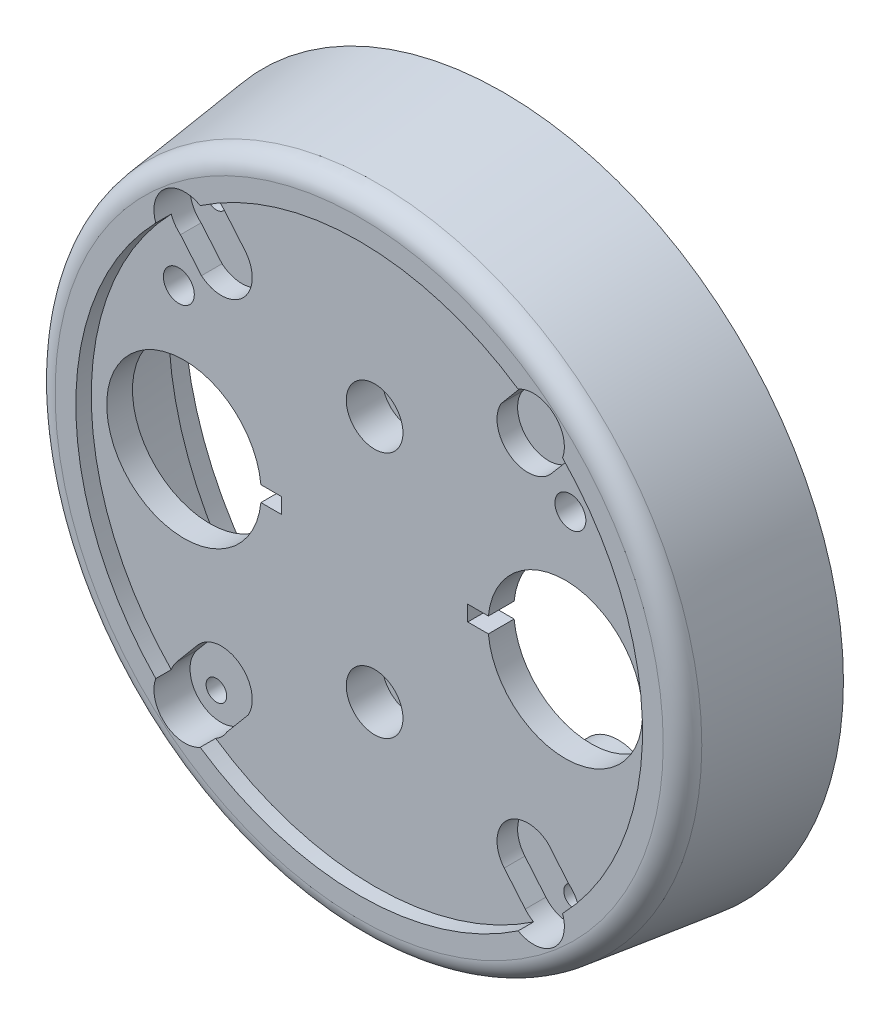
ISO-10303-21;
HEADER;
FILE_DESCRIPTION(('STEP AP214'),'2;1');
FILE_NAME('part.step','',(''),(''),'','','');
FILE_SCHEMA(('AUTOMOTIVE_DESIGN { 1 0 10303 214 1 1 1 1 }'));
ENDSEC;
DATA;
#1=APPLICATION_CONTEXT('core data for automotive mechanical design processes');
#2=APPLICATION_PROTOCOL_DEFINITION('international standard','automotive_design',2000,#1);
#3=PRODUCT_CONTEXT('',#1,'mechanical');
#4=PRODUCT('Part','Part','',(#3));
#5=PRODUCT_RELATED_PRODUCT_CATEGORY('part','',(#4));
#6=PRODUCT_DEFINITION_FORMATION('','',#4);
#7=PRODUCT_DEFINITION_CONTEXT('part definition',#1,'design');
#8=PRODUCT_DEFINITION('design','',#6,#7);
#9=PRODUCT_DEFINITION_SHAPE('','',#8);
#10=(LENGTH_UNIT() NAMED_UNIT(*) SI_UNIT(.MILLI.,.METRE.));
#11=(NAMED_UNIT(*) PLANE_ANGLE_UNIT() SI_UNIT($,.RADIAN.));
#12=(NAMED_UNIT(*) SI_UNIT($,.STERADIAN.) SOLID_ANGLE_UNIT());
#13=UNCERTAINTY_MEASURE_WITH_UNIT(LENGTH_MEASURE(1.E-05),#10,'distance_accuracy_value','');
#14=(GEOMETRIC_REPRESENTATION_CONTEXT(3) GLOBAL_UNCERTAINTY_ASSIGNED_CONTEXT((#13)) GLOBAL_UNIT_ASSIGNED_CONTEXT((#10,
#11,#12)) REPRESENTATION_CONTEXT('',''));
#15=CARTESIAN_POINT('',(0.,0.,0.));
#16=DIRECTION('',(0.,0.,1.));
#17=DIRECTION('',(1.,0.,0.));
#18=AXIS2_PLACEMENT_3D('',#15,#16,#17);
#19=CARTESIAN_POINT('',(17.3552654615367,20.6831999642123,14.));
#20=DIRECTION('',(0.,0.,-1.));
#21=DIRECTION('',(-1.,0.,0.));
#22=AXIS2_PLACEMENT_3D('',#19,#20,#21);
#23=CYLINDRICAL_SURFACE('',#22,1.);
#24=CARTESIAN_POINT('',(17.3552654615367,20.6831999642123,3.));
#25=DIRECTION('',(0.,0.,-1.));
#26=DIRECTION('',(-1.,0.,0.));
#27=AXIS2_PLACEMENT_3D('',#24,#25,#26);
#28=CIRCLE('',#27,1.);
#29=CARTESIAN_POINT('',(16.3552654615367,20.6831999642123,3.));
#30=VERTEX_POINT('',#29);
#31=EDGE_CURVE('E548',#30,#30,#28,.T.);
#32=ORIENTED_EDGE('',*,*,#31,.T.);
#33=EDGE_LOOP('',(#32));
#34=FACE_BOUND('',#33,.T.);
#35=CARTESIAN_POINT('',(17.3552654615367,20.6831999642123,10.5));
#36=DIRECTION('',(0.,0.,1.));
#37=DIRECTION('',(1.,0.,0.));
#38=AXIS2_PLACEMENT_3D('',#35,#36,#37);
#39=CIRCLE('',#38,1.);
#40=CARTESIAN_POINT('',(18.3552654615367,20.6831999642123,10.5));
#41=VERTEX_POINT('',#40);
#42=EDGE_CURVE('E361',#41,#41,#39,.F.);
#43=ORIENTED_EDGE('',*,*,#42,.F.);
#44=EDGE_LOOP('',(#43));
#45=FACE_BOUND('',#44,.T.);
#46=ADVANCED_FACE('F26',(#34,#45),#23,.F.);
#47=CARTESIAN_POINT('',(17.3552654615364,-20.6831999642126,14.));
#48=DIRECTION('',(0.,0.,-1.));
#49=DIRECTION('',(-1.,0.,0.));
#50=AXIS2_PLACEMENT_3D('',#47,#48,#49);
#51=CYLINDRICAL_SURFACE('',#50,1.);
#52=CARTESIAN_POINT('',(17.3552654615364,-20.6831999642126,3.));
#53=DIRECTION('',(0.,0.,-1.));
#54=DIRECTION('',(0.173648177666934,0.984807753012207,0.));
#55=AXIS2_PLACEMENT_3D('',#52,#53,#54);
#56=CIRCLE('',#55,1.);
#57=CARTESIAN_POINT('',(17.5289136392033,-19.6983922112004,3.));
#58=VERTEX_POINT('',#57);
#59=EDGE_CURVE('E545',#58,#58,#56,.T.);
#60=ORIENTED_EDGE('',*,*,#59,.T.);
#61=EDGE_LOOP('',(#60));
#62=FACE_BOUND('',#61,.T.);
#63=CARTESIAN_POINT('',(17.3552654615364,-20.6831999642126,10.5));
#64=DIRECTION('',(0.,0.,1.));
#65=DIRECTION('',(1.,0.,0.));
#66=AXIS2_PLACEMENT_3D('',#63,#64,#65);
#67=CIRCLE('',#66,1.);
#68=CARTESIAN_POINT('',(18.3552654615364,-20.6831999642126,10.5));
#69=VERTEX_POINT('',#68);
#70=EDGE_CURVE('E389',#69,#69,#67,.F.);
#71=ORIENTED_EDGE('',*,*,#70,.F.);
#72=EDGE_LOOP('',(#71));
#73=FACE_BOUND('',#72,.T.);
#74=ADVANCED_FACE('F908',(#62,#73),#51,.F.);
#75=CARTESIAN_POINT('',(-17.3552654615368,-20.6831999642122,14.));
#76=DIRECTION('',(0.,0.,-1.));
#77=DIRECTION('',(-1.,0.,0.));
#78=AXIS2_PLACEMENT_3D('',#75,#76,#77);
#79=CYLINDRICAL_SURFACE('',#78,1.);
#80=CARTESIAN_POINT('',(-17.3552654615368,-20.6831999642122,3.));
#81=DIRECTION('',(0.,0.,-1.));
#82=DIRECTION('',(1.,0.,0.));
#83=AXIS2_PLACEMENT_3D('',#80,#81,#82);
#84=CIRCLE('',#83,1.);
#85=CARTESIAN_POINT('',(-16.3552654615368,-20.6831999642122,3.));
#86=VERTEX_POINT('',#85);
#87=EDGE_CURVE('E533',#86,#86,#84,.T.);
#88=ORIENTED_EDGE('',*,*,#87,.T.);
#89=EDGE_LOOP('',(#88));
#90=FACE_BOUND('',#89,.T.);
#91=CARTESIAN_POINT('',(-17.3552654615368,-20.6831999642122,10.5));
#92=DIRECTION('',(0.,0.,1.));
#93=DIRECTION('',(1.,0.,0.));
#94=AXIS2_PLACEMENT_3D('',#91,#92,#93);
#95=CIRCLE('',#94,1.);
#96=CARTESIAN_POINT('',(-16.3552654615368,-20.6831999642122,10.5));
#97=VERTEX_POINT('',#96);
#98=EDGE_CURVE('E421',#97,#97,#95,.F.);
#99=ORIENTED_EDGE('',*,*,#98,.F.);
#100=EDGE_LOOP('',(#99));
#101=FACE_BOUND('',#100,.T.);
#102=ADVANCED_FACE('F897',(#90,#101),#79,.F.);
#103=CARTESIAN_POINT('',(-17.3552654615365,20.6831999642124,14.));
#104=DIRECTION('',(0.,0.,-1.));
#105=DIRECTION('',(-1.,0.,0.));
#106=AXIS2_PLACEMENT_3D('',#103,#104,#105);
#107=CYLINDRICAL_SURFACE('',#106,1.);
#108=CARTESIAN_POINT('',(-17.3552654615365,20.6831999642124,3.));
#109=DIRECTION('',(0.,0.,-1.));
#110=DIRECTION('',(-0.173648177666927,-0.984807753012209,0.));
#111=AXIS2_PLACEMENT_3D('',#108,#109,#110);
#112=CIRCLE('',#111,1.);
#113=CARTESIAN_POINT('',(-17.5289136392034,19.6983922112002,3.));
#114=VERTEX_POINT('',#113);
#115=EDGE_CURVE('E542',#114,#114,#112,.T.);
#116=ORIENTED_EDGE('',*,*,#115,.T.);
#117=EDGE_LOOP('',(#116));
#118=FACE_BOUND('',#117,.T.);
#119=CARTESIAN_POINT('',(-17.3552654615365,20.6831999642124,10.5));
#120=DIRECTION('',(0.,0.,1.));
#121=DIRECTION('',(1.,0.,0.));
#122=AXIS2_PLACEMENT_3D('',#119,#120,#121);
#123=CIRCLE('',#122,1.);
#124=CARTESIAN_POINT('',(-16.3552654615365,20.6831999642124,10.5));
#125=VERTEX_POINT('',#124);
#126=EDGE_CURVE('E453',#125,#125,#123,.F.);
#127=ORIENTED_EDGE('',*,*,#126,.F.);
#128=EDGE_LOOP('',(#127));
#129=FACE_BOUND('',#128,.T.);
#130=ADVANCED_FACE('F894',(#118,#129),#107,.F.);
#131=CARTESIAN_POINT('',(0.,0.,10.));
#132=DIRECTION('',(0.,0.,-1.));
#133=DIRECTION('',(-1.,0.,0.));
#134=AXIS2_PLACEMENT_3D('',#131,#132,#133);
#135=PLANE('',#134);
#136=CARTESIAN_POINT('',(19.,13.5,10.));
#137=DIRECTION('',(0.,0.,-1.));
#138=DIRECTION('',(-1.,0.,0.));
#139=AXIS2_PLACEMENT_3D('',#136,#137,#138);
#140=CIRCLE('',#139,1.5);
#141=CARTESIAN_POINT('',(17.5,13.5,10.));
#142=VERTEX_POINT('',#141);
#143=EDGE_CURVE('E1360',#142,#142,#140,.T.);
#144=ORIENTED_EDGE('',*,*,#143,.F.);
#145=EDGE_LOOP('',(#144));
#146=FACE_BOUND('',#145,.T.);
#147=CARTESIAN_POINT('',(-19.,13.5,10.));
#148=DIRECTION('',(0.,0.,-1.));
#149=DIRECTION('',(-1.,0.,0.));
#150=AXIS2_PLACEMENT_3D('',#147,#148,#149);
#151=CIRCLE('',#150,1.5);
#152=CARTESIAN_POINT('',(-20.5,13.5,10.));
#153=VERTEX_POINT('',#152);
#154=EDGE_CURVE('E353',#153,#153,#151,.T.);
#155=ORIENTED_EDGE('',*,*,#154,.F.);
#156=EDGE_LOOP('',(#155));
#157=FACE_BOUND('',#156,.T.);
#158=CARTESIAN_POINT('',(0.,12.,10.));
#159=DIRECTION('',(0.,0.,-1.));
#160=DIRECTION('',(-1.,0.,0.));
#161=AXIS2_PLACEMENT_3D('',#158,#159,#160);
#162=CIRCLE('',#161,4.25);
#163=CARTESIAN_POINT('',(-4.25,12.,10.));
#164=VERTEX_POINT('',#163);
#165=EDGE_CURVE('E493',#164,#164,#162,.T.);
#166=ORIENTED_EDGE('',*,*,#165,.F.);
#167=EDGE_LOOP('',(#166));
#168=FACE_BOUND('',#167,.T.);
#169=CARTESIAN_POINT('',(18.5,0.,10.));
#170=DIRECTION('',(0.,0.,-1.));
#171=DIRECTION('',(-1.,0.,0.));
#172=AXIS2_PLACEMENT_3D('',#169,#170,#171);
#173=CIRCLE('',#172,7.5);
#174=CARTESIAN_POINT('',(11.0375942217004,0.75,10.));
#175=VERTEX_POINT('',#174);
#176=CARTESIAN_POINT('',(11.0375942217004,-0.75,10.));
#177=VERTEX_POINT('',#176);
#178=EDGE_CURVE('E499',#175,#177,#173,.T.);
#179=ORIENTED_EDGE('',*,*,#178,.F.);
#180=DIRECTION('',(1.,0.,0.));
#181=VECTOR('',#180,1.);
#182=CARTESIAN_POINT('',(11.0375942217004,0.75,10.));
#183=LINE('',#182,#181);
#184=CARTESIAN_POINT('',(9.03759422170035,0.75,10.));
#185=VERTEX_POINT('',#184);
#186=EDGE_CURVE('E507',#185,#175,#183,.T.);
#187=ORIENTED_EDGE('',*,*,#186,.F.);
#188=DIRECTION('',(0.,1.,0.));
#189=VECTOR('',#188,1.);
#190=CARTESIAN_POINT('',(9.03759422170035,0.75,10.));
#191=LINE('',#190,#189);
#192=CARTESIAN_POINT('',(9.03759422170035,-0.75,10.));
#193=VERTEX_POINT('',#192);
#194=EDGE_CURVE('E504',#193,#185,#191,.T.);
#195=ORIENTED_EDGE('',*,*,#194,.F.);
#196=DIRECTION('',(-1.,0.,0.));
#197=VECTOR('',#196,1.);
#198=CARTESIAN_POINT('',(11.0375942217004,-0.75,10.));
#199=LINE('',#198,#197);
#200=EDGE_CURVE('E501',#177,#193,#199,.T.);
#201=ORIENTED_EDGE('',*,*,#200,.F.);
#202=EDGE_LOOP('',(#179,#187,#195,#201));
#203=FACE_BOUND('',#202,.T.);
#204=CARTESIAN_POINT('',(-18.5,0.,10.));
#205=DIRECTION('',(0.,0.,-1.));
#206=DIRECTION('',(-1.,0.,0.));
#207=AXIS2_PLACEMENT_3D('',#204,#205,#206);
#208=CIRCLE('',#207,7.5);
#209=CARTESIAN_POINT('',(-11.0375942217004,-0.75,10.));
#210=VERTEX_POINT('',#209);
#211=CARTESIAN_POINT('',(-11.0375942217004,0.75,10.));
#212=VERTEX_POINT('',#211);
#213=EDGE_CURVE('E513',#210,#212,#208,.T.);
#214=ORIENTED_EDGE('',*,*,#213,.F.);
#215=DIRECTION('',(-1.,0.,0.));
#216=VECTOR('',#215,1.);
#217=CARTESIAN_POINT('',(-9.03759422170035,-0.75,10.));
#218=LINE('',#217,#216);
#219=CARTESIAN_POINT('',(-9.03759422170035,-0.75,10.));
#220=VERTEX_POINT('',#219);
#221=EDGE_CURVE('E527',#220,#210,#218,.T.);
#222=ORIENTED_EDGE('',*,*,#221,.F.);
#223=DIRECTION('',(0.,-1.,0.));
#224=VECTOR('',#223,1.);
#225=CARTESIAN_POINT('',(-9.03759422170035,0.75,10.));
#226=LINE('',#225,#224);
#227=CARTESIAN_POINT('',(-9.03759422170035,0.75,10.));
#228=VERTEX_POINT('',#227);
#229=EDGE_CURVE('E524',#228,#220,#226,.T.);
#230=ORIENTED_EDGE('',*,*,#229,.F.);
#231=DIRECTION('',(1.,0.,0.));
#232=VECTOR('',#231,1.);
#233=CARTESIAN_POINT('',(-9.03759422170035,0.75,10.));
#234=LINE('',#233,#232);
#235=EDGE_CURVE('E521',#212,#228,#234,.T.);
#236=ORIENTED_EDGE('',*,*,#235,.F.);
#237=EDGE_LOOP('',(#214,#222,#230,#236));
#238=FACE_BOUND('',#237,.T.);
#239=CARTESIAN_POINT('',(0.,0.,10.));
#240=DIRECTION('',(0.,0.,-1.));
#241=DIRECTION('',(-1.,0.,0.));
#242=AXIS2_PLACEMENT_3D('',#239,#240,#241);
#243=CIRCLE('',#242,29.3438350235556);
#244=CARTESIAN_POINT('',(15.6216110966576,-24.8400064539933,10.));
#245=VERTEX_POINT('',#244);
#246=CARTESIAN_POINT('',(-15.6216110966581,-24.840006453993,10.));
#247=VERTEX_POINT('',#246);
#248=EDGE_CURVE('E711',#245,#247,#243,.T.);
#249=ORIENTED_EDGE('',*,*,#248,.T.);
#250=DIRECTION('',(-0.642787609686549,-0.76604444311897,0.));
#251=VECTOR('',#250,1.);
#252=CARTESIAN_POINT('',(-16.6956611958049,-26.1200095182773,10.));
#253=LINE('',#252,#251);
#254=CARTESIAN_POINT('',(-11.0771496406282,-19.4241281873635,10.));
#255=VERTEX_POINT('',#254);
#256=EDGE_CURVE('E554',#255,#247,#253,.T.);
#257=ORIENTED_EDGE('',*,*,#256,.F.);
#258=CARTESIAN_POINT('',(-14.1413274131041,-16.8529777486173,10.));
#259=DIRECTION('',(0.,0.,-1.));
#260=DIRECTION('',(1.,0.,0.));
#261=AXIS2_PLACEMENT_3D('',#258,#259,#260);
#262=CIRCLE('',#261,4.);
#263=CARTESIAN_POINT('',(-17.20550518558,-14.2818273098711,10.));
#264=VERTEX_POINT('',#263);
#265=EDGE_CURVE('E551',#264,#255,#262,.T.);
#266=ORIENTED_EDGE('',*,*,#265,.F.);
#267=DIRECTION('',(-0.64278760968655,-0.766044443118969,0.));
#268=VECTOR('',#267,1.);
#269=CARTESIAN_POINT('',(-3.06417777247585,2.57115043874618,10.));
#270=LINE('',#269,#268);
#271=CARTESIAN_POINT('',(-21.7499666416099,-19.6977055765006,10.));
#272=VERTEX_POINT('',#271);
#273=EDGE_CURVE('E753',#264,#272,#270,.T.);
#274=ORIENTED_EDGE('',*,*,#273,.T.);
#275=CARTESIAN_POINT('',(-21.7499666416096,19.6977055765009,10.));
#276=VERTEX_POINT('',#275);
#277=EDGE_CURVE('E712',#272,#276,#243,.T.);
#278=ORIENTED_EDGE('',*,*,#277,.T.);
#279=DIRECTION('',(-0.642787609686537,0.76604444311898,0.));
#280=VECTOR('',#279,1.);
#281=CARTESIAN_POINT('',(-22.8240167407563,20.9777086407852,10.));
#282=LINE('',#281,#280);
#283=CARTESIAN_POINT('',(-17.2055051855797,14.2818273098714,10.));
#284=VERTEX_POINT('',#283);
#285=EDGE_CURVE('E1491',#284,#276,#282,.T.);
#286=ORIENTED_EDGE('',*,*,#285,.F.);
#287=CARTESIAN_POINT('',(-14.1413274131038,16.8529777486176,10.));
#288=DIRECTION('',(0.,0.,-1.));
#289=DIRECTION('',(-0.173648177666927,-0.984807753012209,0.));
#290=AXIS2_PLACEMENT_3D('',#287,#288,#289);
#291=CIRCLE('',#290,4.);
#292=CARTESIAN_POINT('',(-11.0771496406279,19.4241281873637,10.));
#293=VERTEX_POINT('',#292);
#294=EDGE_CURVE('E1497',#293,#284,#291,.T.);
#295=ORIENTED_EDGE('',*,*,#294,.F.);
#296=DIRECTION('',(-0.642787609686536,0.76604444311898,0.));
#297=VECTOR('',#296,1.);
#298=CARTESIAN_POINT('',(3.0641777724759,2.57115043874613,10.));
#299=LINE('',#298,#297);
#300=CARTESIAN_POINT('',(-15.6216110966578,24.8400064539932,10.));
#301=VERTEX_POINT('',#300);
#302=EDGE_CURVE('E747',#293,#301,#299,.T.);
#303=ORIENTED_EDGE('',*,*,#302,.T.);
#304=CARTESIAN_POINT('',(15.621611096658,24.8400064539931,10.));
#305=VERTEX_POINT('',#304);
#306=EDGE_CURVE('E706',#301,#305,#243,.T.);
#307=ORIENTED_EDGE('',*,*,#306,.T.);
#308=DIRECTION('',(0.642787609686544,0.766044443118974,0.));
#309=VECTOR('',#308,1.);
#310=CARTESIAN_POINT('',(16.6956611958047,26.1200095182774,10.));
#311=LINE('',#310,#309);
#312=CARTESIAN_POINT('',(11.0771496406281,19.4241281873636,10.));
#313=VERTEX_POINT('',#312);
#314=EDGE_CURVE('E1085',#313,#305,#311,.T.);
#315=ORIENTED_EDGE('',*,*,#314,.F.);
#316=CARTESIAN_POINT('',(14.141327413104,16.8529777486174,10.));
#317=DIRECTION('',(0.,0.,-1.));
#318=DIRECTION('',(-1.,0.,0.));
#319=AXIS2_PLACEMENT_3D('',#316,#317,#318);
#320=CIRCLE('',#319,4.);
#321=CARTESIAN_POINT('',(17.2055051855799,14.2818273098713,10.));
#322=VERTEX_POINT('',#321);
#323=EDGE_CURVE('E1094',#322,#313,#320,.T.);
#324=ORIENTED_EDGE('',*,*,#323,.F.);
#325=DIRECTION('',(0.642787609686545,0.766044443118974,0.));
#326=VECTOR('',#325,1.);
#327=CARTESIAN_POINT('',(3.06417777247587,-2.57115043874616,10.));
#328=LINE('',#327,#326);
#329=CARTESIAN_POINT('',(21.7499666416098,19.6977055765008,10.));
#330=VERTEX_POINT('',#329);
#331=EDGE_CURVE('E735',#322,#330,#328,.T.);
#332=ORIENTED_EDGE('',*,*,#331,.T.);
#333=CARTESIAN_POINT('',(21.7499666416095,-19.6977055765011,10.));
#334=VERTEX_POINT('',#333);
#335=EDGE_CURVE('E707',#330,#334,#243,.T.);
#336=ORIENTED_EDGE('',*,*,#335,.T.);
#337=DIRECTION('',(0.642787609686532,-0.766044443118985,0.));
#338=VECTOR('',#337,1.);
#339=CARTESIAN_POINT('',(22.8240167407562,-20.9777086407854,10.));
#340=LINE('',#339,#338);
#341=CARTESIAN_POINT('',(17.2055051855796,-14.2818273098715,10.));
#342=VERTEX_POINT('',#341);
#343=EDGE_CURVE('E634',#342,#334,#340,.T.);
#344=ORIENTED_EDGE('',*,*,#343,.F.);
#345=CARTESIAN_POINT('',(14.1413274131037,-16.8529777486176,10.));
#346=DIRECTION('',(0.,0.,-1.));
#347=DIRECTION('',(0.173648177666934,0.984807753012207,0.));
#348=AXIS2_PLACEMENT_3D('',#345,#346,#347);
#349=CIRCLE('',#348,4.);
#350=CARTESIAN_POINT('',(11.0771496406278,-19.4241281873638,10.));
#351=VERTEX_POINT('',#350);
#352=EDGE_CURVE('E631',#351,#342,#349,.T.);
#353=ORIENTED_EDGE('',*,*,#352,.F.);
#354=DIRECTION('',(0.642787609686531,-0.766044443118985,0.));
#355=VECTOR('',#354,1.);
#356=CARTESIAN_POINT('',(-3.06417777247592,-2.57115043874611,10.));
#357=LINE('',#356,#355);
#358=EDGE_CURVE('E741',#351,#245,#357,.T.);
#359=ORIENTED_EDGE('',*,*,#358,.T.);
#360=EDGE_LOOP('',(#249,#257,#266,#274,#278,#286,#295,#303,#307,#315,#324,#332,#336,#344,#353,#359));
#361=FACE_BOUND('',#360,.T.);
#362=CARTESIAN_POINT('',(0.,-12.,10.));
#363=DIRECTION('',(0.,0.,-1.));
#364=DIRECTION('',(-1.,0.,0.));
#365=AXIS2_PLACEMENT_3D('',#362,#363,#364);
#366=CIRCLE('',#365,4.25);
#367=CARTESIAN_POINT('',(-4.25,-12.,10.));
#368=VERTEX_POINT('',#367);
#369=EDGE_CURVE('E487',#368,#368,#366,.T.);
#370=ORIENTED_EDGE('',*,*,#369,.F.);
#371=EDGE_LOOP('',(#370));
#372=FACE_BOUND('',#371,.T.);
#373=ADVANCED_FACE('F896',(#146,#157,#168,#203,#238,#361,#372),#135,.T.);
#374=CARTESIAN_POINT('',(0.,0.,12.5));
#375=DIRECTION('',(0.,0.,1.));
#376=DIRECTION('',(1.,0.,0.));
#377=AXIS2_PLACEMENT_3D('',#374,#375,#376);
#378=CYLINDRICAL_SURFACE('',#377,27.5);
#379=CARTESIAN_POINT('',(0.,0.,14.));
#380=DIRECTION('',(0.,0.,1.));
#381=DIRECTION('',(1.,0.,0.));
#382=AXIS2_PLACEMENT_3D('',#379,#380,#381);
#383=CIRCLE('',#382,27.5);
#384=CARTESIAN_POINT('',(-15.4279758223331,-22.7646120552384,14.));
#385=VERTEX_POINT('',#384);
#386=CARTESIAN_POINT('',(15.4279758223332,-22.7646120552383,14.));
#387=VERTEX_POINT('',#386);
#388=EDGE_CURVE('E861',#385,#387,#383,.T.);
#389=ORIENTED_EDGE('',*,*,#388,.T.);
#390=DIRECTION('',(0.,0.,1.));
#391=VECTOR('',#390,1.);
#392=CARTESIAN_POINT('',(15.4279758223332,-22.7646120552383,12.25));
#393=LINE('',#392,#391);
#394=CARTESIAN_POINT('',(15.4279758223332,-22.7646120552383,12.5));
#395=VERTEX_POINT('',#394);
#396=EDGE_CURVE('E400',#387,#395,#393,.F.);
#397=ORIENTED_EDGE('',*,*,#396,.T.);
#398=CARTESIAN_POINT('',(0.,0.,12.5));
#399=DIRECTION('',(0.,0.,1.));
#400=DIRECTION('',(1.,0.,0.));
#401=AXIS2_PLACEMENT_3D('',#398,#399,#400);
#402=CIRCLE('',#401,27.5);
#403=CARTESIAN_POINT('',(-15.4279758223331,-22.7646120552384,12.5));
#404=VERTEX_POINT('',#403);
#405=EDGE_CURVE('E835',#404,#395,#402,.T.);
#406=ORIENTED_EDGE('',*,*,#405,.F.);
#407=DIRECTION('',(0.,0.,1.));
#408=VECTOR('',#407,1.);
#409=CARTESIAN_POINT('',(-15.4279758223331,-22.7646120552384,12.25));
#410=LINE('',#409,#408);
#411=EDGE_CURVE('E429',#404,#385,#410,.T.);
#412=ORIENTED_EDGE('',*,*,#411,.T.);
#413=EDGE_LOOP('',(#389,#397,#406,#412));
#414=FACE_BOUND('',#413,.T.);
#415=ADVANCED_FACE('F905',(#414),#378,.F.);
#416=CARTESIAN_POINT('',(-19.7397265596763,19.1466236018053,14.));
#417=VERTEX_POINT('',#416);
#418=CARTESIAN_POINT('',(-19.739726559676,-19.1466236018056,14.));
#419=VERTEX_POINT('',#418);
#420=EDGE_CURVE('E722',#417,#419,#383,.T.);
#421=ORIENTED_EDGE('',*,*,#420,.T.);
#422=DIRECTION('',(0.,0.,1.));
#423=VECTOR('',#422,1.);
#424=CARTESIAN_POINT('',(-19.739726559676,-19.1466236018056,12.25));
#425=LINE('',#424,#423);
#426=CARTESIAN_POINT('',(-19.739726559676,-19.1466236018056,12.5));
#427=VERTEX_POINT('',#426);
#428=EDGE_CURVE('E432',#419,#427,#425,.F.);
#429=ORIENTED_EDGE('',*,*,#428,.T.);
#430=CARTESIAN_POINT('',(-19.7397265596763,19.1466236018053,12.5));
#431=VERTEX_POINT('',#430);
#432=EDGE_CURVE('E726',#431,#427,#402,.T.);
#433=ORIENTED_EDGE('',*,*,#432,.F.);
#434=DIRECTION('',(0.,0.,1.));
#435=VECTOR('',#434,1.);
#436=CARTESIAN_POINT('',(-19.7397265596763,19.1466236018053,12.25));
#437=LINE('',#436,#435);
#438=EDGE_CURVE('E461',#431,#417,#437,.T.);
#439=ORIENTED_EDGE('',*,*,#438,.T.);
#440=EDGE_LOOP('',(#421,#429,#433,#439));
#441=FACE_BOUND('',#440,.T.);
#442=ADVANCED_FACE('F848',(#441),#378,.F.);
#443=CARTESIAN_POINT('',(19.7397265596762,-19.1466236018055,14.));
#444=VERTEX_POINT('',#443);
#445=CARTESIAN_POINT('',(19.7397265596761,19.1466236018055,14.));
#446=VERTEX_POINT('',#445);
#447=EDGE_CURVE('E718',#444,#446,#383,.T.);
#448=ORIENTED_EDGE('',*,*,#447,.T.);
#449=DIRECTION('',(0.,0.,1.));
#450=VECTOR('',#449,1.);
#451=CARTESIAN_POINT('',(19.7397265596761,19.1466236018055,12.25));
#452=LINE('',#451,#450);
#453=CARTESIAN_POINT('',(19.7397265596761,19.1466236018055,12.5));
#454=VERTEX_POINT('',#453);
#455=EDGE_CURVE('E369',#446,#454,#452,.F.);
#456=ORIENTED_EDGE('',*,*,#455,.T.);
#457=CARTESIAN_POINT('',(19.7397265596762,-19.1466236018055,12.5));
#458=VERTEX_POINT('',#457);
#459=EDGE_CURVE('E721',#458,#454,#402,.T.);
#460=ORIENTED_EDGE('',*,*,#459,.F.);
#461=DIRECTION('',(0.,0.,1.));
#462=VECTOR('',#461,1.);
#463=CARTESIAN_POINT('',(19.7397265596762,-19.1466236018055,12.25));
#464=LINE('',#463,#462);
#465=EDGE_CURVE('E397',#458,#444,#464,.T.);
#466=ORIENTED_EDGE('',*,*,#465,.T.);
#467=EDGE_LOOP('',(#448,#456,#460,#466));
#468=FACE_BOUND('',#467,.T.);
#469=ADVANCED_FACE('F865',(#468),#378,.F.);
#470=CARTESIAN_POINT('',(0.,0.,2.5));
#471=DIRECTION('',(0.,0.,-1.));
#472=DIRECTION('',(-1.,0.,0.));
#473=AXIS2_PLACEMENT_3D('',#470,#471,#472);
#474=CONICAL_SURFACE('',#473,30.,0.0872664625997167);
#475=CARTESIAN_POINT('',(0.,0.,2.5));
#476=DIRECTION('',(0.,0.,-1.));
#477=DIRECTION('',(-1.,0.,0.));
#478=AXIS2_PLACEMENT_3D('',#475,#476,#477);
#479=CIRCLE('',#478,30.);
#480=CARTESIAN_POINT('',(-30.,0.,2.5));
#481=VERTEX_POINT('',#480);
#482=EDGE_CURVE('E703',#481,#481,#479,.T.);
#483=ORIENTED_EDGE('',*,*,#482,.T.);
#484=EDGE_LOOP('',(#483));
#485=FACE_BOUND('',#484,.T.);
#486=CARTESIAN_POINT('',(-15.6215997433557,-24.839992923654,10.0002));
#487=CARTESIAN_POINT('',(-15.6878308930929,-24.918924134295,8.83346839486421));
#488=CARTESIAN_POINT('',(-15.7540557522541,-24.9978478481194,7.66673592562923));
#489=CARTESIAN_POINT('',(-15.8864928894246,-25.1556802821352,5.33326925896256));
#490=CARTESIAN_POINT('',(-15.9527051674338,-25.2345890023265,4.16653506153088));
#491=CARTESIAN_POINT('',(-16.018911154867,-25.3134902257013,2.9998));
#492=B_SPLINE_CURVE_WITH_KNOTS('',3,(#486,#487,#488,#489,#490,#491),.UNSPECIFIED.,.F.,.F.,(4,2,
4),(0.,3.51381758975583,7.02763517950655),.UNSPECIFIED.);
#493=CARTESIAN_POINT('',(-16.0188998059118,-25.3134767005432,3.));
#494=VERTEX_POINT('',#493);
#495=EDGE_CURVE('E576',#247,#494,#492,.T.);
#496=ORIENTED_EDGE('',*,*,#495,.F.);
#497=ORIENTED_EDGE('',*,*,#248,.F.);
#498=CARTESIAN_POINT('',(16.0189111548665,-25.3134902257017,2.9998));
#499=CARTESIAN_POINT('',(15.9527051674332,-25.2345890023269,4.16653506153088));
#500=CARTESIAN_POINT('',(15.886492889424,-25.1556802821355,5.33326925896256));
#501=CARTESIAN_POINT('',(15.7540557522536,-24.9978478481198,7.66673592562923));
#502=CARTESIAN_POINT('',(15.6878308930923,-24.9189241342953,8.83346839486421));
#503=CARTESIAN_POINT('',(15.6215997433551,-24.8399929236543,10.0002));
#504=B_SPLINE_CURVE_WITH_KNOTS('',3,(#498,#499,#500,#501,#502,#503),.UNSPECIFIED.,.F.,.F.,(4,2,
4),(0.,3.51381758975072,7.02763517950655),.UNSPECIFIED.);
#505=CARTESIAN_POINT('',(16.0188998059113,-25.3134767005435,3.));
#506=VERTEX_POINT('',#505);
#507=EDGE_CURVE('E649',#506,#245,#504,.T.);
#508=ORIENTED_EDGE('',*,*,#507,.F.);
#509=CARTESIAN_POINT('',(0.,0.,3.));
#510=DIRECTION('',(0.,0.,-1.));
#511=DIRECTION('',(-1.,0.,0.));
#512=AXIS2_PLACEMENT_3D('',#509,#510,#511);
#513=CIRCLE('',#512,29.956255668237);
#514=CARTESIAN_POINT('',(22.1472553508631,-20.1711758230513,3.));
#515=VERTEX_POINT('',#514);
#516=EDGE_CURVE('E744',#506,#515,#513,.F.);
#517=ORIENTED_EDGE('',*,*,#516,.T.);
#518=CARTESIAN_POINT('',(21.749955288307,-19.6976920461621,10.0002));
#519=CARTESIAN_POINT('',(21.8161864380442,-19.776623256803,8.83346839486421));
#520=CARTESIAN_POINT('',(21.8824112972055,-19.8555469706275,7.66673592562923));
#521=CARTESIAN_POINT('',(22.0148484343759,-20.0133794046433,5.33326925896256));
#522=CARTESIAN_POINT('',(22.0810607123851,-20.0922881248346,4.16653506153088));
#523=CARTESIAN_POINT('',(22.1472666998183,-20.1711893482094,2.9998));
#524=B_SPLINE_CURVE_WITH_KNOTS('',3,(#518,#519,#520,#521,#522,#523),.UNSPECIFIED.,.F.,.F.,(4,2,
4),(0.,3.51381758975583,7.02763517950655),.UNSPECIFIED.);
#525=EDGE_CURVE('E655',#334,#515,#524,.T.);
#526=ORIENTED_EDGE('',*,*,#525,.F.);
#527=ORIENTED_EDGE('',*,*,#335,.F.);
#528=CARTESIAN_POINT('',(22.1472666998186,20.1711893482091,2.9998));
#529=CARTESIAN_POINT('',(22.0810607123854,20.0922881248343,4.16653506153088));
#530=CARTESIAN_POINT('',(22.0148484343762,20.013379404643,5.33326925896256));
#531=CARTESIAN_POINT('',(21.8824112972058,19.8555469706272,7.66673592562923));
#532=CARTESIAN_POINT('',(21.8161864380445,19.7766232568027,8.83346839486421));
#533=CARTESIAN_POINT('',(21.7499552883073,19.6976920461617,10.0002));
#534=B_SPLINE_CURVE_WITH_KNOTS('',3,(#528,#529,#530,#531,#532,#533),.UNSPECIFIED.,.F.,.F.,(4,2,
4),(0.,3.51381758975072,7.02763517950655),.UNSPECIFIED.);
#535=CARTESIAN_POINT('',(22.1472553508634,20.1711758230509,3.));
#536=VERTEX_POINT('',#535);
#537=EDGE_CURVE('E690',#536,#330,#534,.T.);
#538=ORIENTED_EDGE('',*,*,#537,.F.);
#539=CARTESIAN_POINT('',(0.,0.,3.));
#540=DIRECTION('',(0.,0.,-1.));
#541=DIRECTION('',(-1.,0.,0.));
#542=AXIS2_PLACEMENT_3D('',#539,#540,#541);
#543=CIRCLE('',#542,29.956255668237);
#544=CARTESIAN_POINT('',(16.0188998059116,25.3134767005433,3.));
#545=VERTEX_POINT('',#544);
#546=EDGE_CURVE('E738',#536,#545,#543,.F.);
#547=ORIENTED_EDGE('',*,*,#546,.T.);
#548=CARTESIAN_POINT('',(15.6215997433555,24.8399929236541,10.0002));
#549=CARTESIAN_POINT('',(15.6878308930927,24.9189241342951,8.83346839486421));
#550=CARTESIAN_POINT('',(15.754055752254,24.9978478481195,7.66673592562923));
#551=CARTESIAN_POINT('',(15.8864928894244,25.1556802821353,5.33326925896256));
#552=CARTESIAN_POINT('',(15.9527051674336,25.2345890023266,4.16653506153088));
#553=CARTESIAN_POINT('',(16.0189111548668,25.3134902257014,2.9998));
#554=B_SPLINE_CURVE_WITH_KNOTS('',3,(#548,#549,#550,#551,#552,#553),.UNSPECIFIED.,.F.,.F.,(4,2,
4),(0.,3.51381758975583,7.02763517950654),.UNSPECIFIED.);
#555=EDGE_CURVE('E696',#305,#545,#554,.T.);
#556=ORIENTED_EDGE('',*,*,#555,.F.);
#557=ORIENTED_EDGE('',*,*,#306,.F.);
#558=CARTESIAN_POINT('',(-16.0189111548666,25.3134902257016,2.9998));
#559=CARTESIAN_POINT('',(-15.9527051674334,25.2345890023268,4.16653506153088));
#560=CARTESIAN_POINT('',(-15.8864928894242,25.1556802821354,5.33326925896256));
#561=CARTESIAN_POINT('',(-15.7540557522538,24.9978478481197,7.66673592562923));
#562=CARTESIAN_POINT('',(-15.6878308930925,24.9189241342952,8.83346839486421));
#563=CARTESIAN_POINT('',(-15.6215997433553,24.8399929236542,10.0002));
#564=B_SPLINE_CURVE_WITH_KNOTS('',3,(#558,#559,#560,#561,#562,#563),.UNSPECIFIED.,.F.,.F.,(4,2,
4),(0.,3.51381758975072,7.02763517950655),.UNSPECIFIED.);
#565=CARTESIAN_POINT('',(-16.0188998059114,25.3134767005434,3.));
#566=VERTEX_POINT('',#565);
#567=EDGE_CURVE('E618',#566,#301,#564,.T.);
#568=ORIENTED_EDGE('',*,*,#567,.F.);
#569=CARTESIAN_POINT('',(0.,0.,3.));
#570=DIRECTION('',(0.,0.,-1.));
#571=DIRECTION('',(-1.,0.,0.));
#572=AXIS2_PLACEMENT_3D('',#569,#570,#571);
#573=CIRCLE('',#572,29.956255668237);
#574=CARTESIAN_POINT('',(-22.1472553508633,20.1711758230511,3.));
#575=VERTEX_POINT('',#574);
#576=EDGE_CURVE('E750',#566,#575,#573,.F.);
#577=ORIENTED_EDGE('',*,*,#576,.T.);
#578=CARTESIAN_POINT('',(-21.7499552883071,19.6976920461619,10.0002));
#579=CARTESIAN_POINT('',(-21.8161864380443,19.7766232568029,8.83346839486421));
#580=CARTESIAN_POINT('',(-21.8824112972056,19.8555469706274,7.66673592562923));
#581=CARTESIAN_POINT('',(-22.014848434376,20.0133794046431,5.33326925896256));
#582=CARTESIAN_POINT('',(-22.0810607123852,20.0922881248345,4.16653506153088));
#583=CARTESIAN_POINT('',(-22.1472666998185,20.1711893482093,2.9998));
#584=B_SPLINE_CURVE_WITH_KNOTS('',3,(#578,#579,#580,#581,#582,#583),.UNSPECIFIED.,.F.,.F.,(4,2,
4),(0.,3.51381758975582,7.02763517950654),.UNSPECIFIED.);
#585=EDGE_CURVE('E624',#276,#575,#584,.T.);
#586=ORIENTED_EDGE('',*,*,#585,.F.);
#587=ORIENTED_EDGE('',*,*,#277,.F.);
#588=CARTESIAN_POINT('',(-22.1472666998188,-20.1711893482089,2.9998));
#589=CARTESIAN_POINT('',(-22.0810607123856,-20.0922881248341,4.16653506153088));
#590=CARTESIAN_POINT('',(-22.0148484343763,-20.0133794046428,5.33326925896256));
#591=CARTESIAN_POINT('',(-21.8824112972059,-19.855546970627,7.66673592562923));
#592=CARTESIAN_POINT('',(-21.8161864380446,-19.7766232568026,8.83346839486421));
#593=CARTESIAN_POINT('',(-21.7499552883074,-19.6976920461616,10.0002));
#594=B_SPLINE_CURVE_WITH_KNOTS('',3,(#588,#589,#590,#591,#592,#593),.UNSPECIFIED.,.F.,.F.,(4,2,
4),(0.,3.51381758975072,7.02763517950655),.UNSPECIFIED.);
#595=CARTESIAN_POINT('',(-22.1472553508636,-20.1711758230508,3.));
#596=VERTEX_POINT('',#595);
#597=EDGE_CURVE('E569',#596,#272,#594,.T.);
#598=ORIENTED_EDGE('',*,*,#597,.F.);
#599=CARTESIAN_POINT('',(0.,0.,3.));
#600=DIRECTION('',(0.,0.,-1.));
#601=DIRECTION('',(-1.,0.,0.));
#602=AXIS2_PLACEMENT_3D('',#599,#600,#601);
#603=CIRCLE('',#602,29.956255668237);
#604=EDGE_CURVE('E756',#596,#494,#603,.F.);
#605=ORIENTED_EDGE('',*,*,#604,.T.);
#606=EDGE_LOOP('',(#496,#497,#508,#517,#526,#527,#538,#547,#556,#557,#568,#577,#586,#587,#598,#605));
#607=FACE_BOUND('',#606,.T.);
#608=ADVANCED_FACE('F582',(#485,#607),#474,.F.);
#609=CARTESIAN_POINT('',(0.,0.,0.));
#610=DIRECTION('',(0.,0.,-1.));
#611=DIRECTION('',(1.,0.,0.));
#612=AXIS2_PLACEMENT_3D('',#609,#610,#611);
#613=CONICAL_SURFACE('',#612,33.,0.122173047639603);
#614=CARTESIAN_POINT('',(0.,0.,12.2437386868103));
#615=DIRECTION('',(0.,0.,-1.));
#616=DIRECTION('',(-1.,0.,0.));
#617=AXIS2_PLACEMENT_3D('',#614,#615,#616);
#618=CIRCLE('',#617,31.4966579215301);
#619=CARTESIAN_POINT('',(-31.4966579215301,0.,12.2437386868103));
#620=VERTEX_POINT('',#619);
#621=EDGE_CURVE('E732',#620,#620,#618,.T.);
#622=ORIENTED_EDGE('',*,*,#621,.T.);
#623=EDGE_LOOP('',(#622));
#624=FACE_BOUND('',#623,.T.);
#625=CARTESIAN_POINT('',(0.,0.,0.));
#626=DIRECTION('',(0.,0.,1.));
#627=DIRECTION('',(1.,0.,0.));
#628=AXIS2_PLACEMENT_3D('',#625,#626,#627);
#629=CIRCLE('',#628,33.);
#630=CARTESIAN_POINT('',(33.,0.,0.));
#631=VERTEX_POINT('',#630);
#632=EDGE_CURVE('E725',#631,#631,#629,.T.);
#633=ORIENTED_EDGE('',*,*,#632,.T.);
#634=EDGE_LOOP('',(#633));
#635=FACE_BOUND('',#634,.T.);
#636=ADVANCED_FACE('F28',(#624,#635),#613,.T.);
#637=CARTESIAN_POINT('',(0.,0.,14.));
#638=DIRECTION('',(0.,0.,1.));
#639=DIRECTION('',(1.,0.,0.));
#640=AXIS2_PLACEMENT_3D('',#637,#638,#639);
#641=PLANE('',#640);
#642=CARTESIAN_POINT('',(16.9159267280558,20.1596164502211,14.));
#643=DIRECTION('',(0.,0.,1.));
#644=DIRECTION('',(0.173648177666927,-0.984807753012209,0.));
#645=AXIS2_PLACEMENT_3D('',#642,#643,#644);
#646=CIRCLE('',#645,3.);
#647=CARTESIAN_POINT('',(15.4279758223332,22.7646120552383,14.));
#648=VERTEX_POINT('',#647);
#649=EDGE_CURVE('E351',#446,#648,#646,.T.);
#650=ORIENTED_EDGE('',*,*,#649,.F.);
#651=ORIENTED_EDGE('',*,*,#447,.F.);
#652=CARTESIAN_POINT('',(16.9159267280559,-20.159616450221,14.));
#653=DIRECTION('',(0.,0.,1.));
#654=DIRECTION('',(-1.,0.,0.));
#655=AXIS2_PLACEMENT_3D('',#652,#653,#654);
#656=CIRCLE('',#655,3.);
#657=EDGE_CURVE('E372',#387,#444,#656,.T.);
#658=ORIENTED_EDGE('',*,*,#657,.F.);
#659=ORIENTED_EDGE('',*,*,#388,.F.);
#660=CARTESIAN_POINT('',(-16.9159267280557,-20.1596164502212,14.));
#661=DIRECTION('',(0.,0.,1.));
#662=DIRECTION('',(-0.173648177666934,0.984807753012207,0.));
#663=AXIS2_PLACEMENT_3D('',#660,#661,#662);
#664=CIRCLE('',#663,3.);
#665=EDGE_CURVE('E403',#419,#385,#664,.T.);
#666=ORIENTED_EDGE('',*,*,#665,.F.);
#667=ORIENTED_EDGE('',*,*,#420,.F.);
#668=CARTESIAN_POINT('',(-16.915926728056,20.1596164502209,14.));
#669=DIRECTION('',(0.,0.,1.));
#670=DIRECTION('',(1.,0.,0.));
#671=AXIS2_PLACEMENT_3D('',#668,#669,#670);
#672=CIRCLE('',#671,3.);
#673=CARTESIAN_POINT('',(-15.4279758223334,22.7646120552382,14.));
#674=VERTEX_POINT('',#673);
#675=EDGE_CURVE('E435',#674,#417,#672,.T.);
#676=ORIENTED_EDGE('',*,*,#675,.F.);
#677=EDGE_CURVE('E719',#648,#674,#383,.T.);
#678=ORIENTED_EDGE('',*,*,#677,.F.);
#679=EDGE_LOOP('',(#650,#651,#658,#659,#666,#667,#676,#678));
#680=FACE_BOUND('',#679,.T.);
#681=CARTESIAN_POINT('',(0.,0.,14.));
#682=DIRECTION('',(0.,0.,1.));
#683=DIRECTION('',(1.,0.,0.));
#684=AXIS2_PLACEMENT_3D('',#681,#682,#683);
#685=CIRCLE('',#684,29.5115656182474);
#686=CARTESIAN_POINT('',(29.5115656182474,0.,14.));
#687=VERTEX_POINT('',#686);
#688=EDGE_CURVE('E729',#687,#687,#685,.T.);
#689=ORIENTED_EDGE('',*,*,#688,.T.);
#690=EDGE_LOOP('',(#689));
#691=FACE_BOUND('',#690,.T.);
#692=ADVANCED_FACE('F856',(#680,#691),#641,.T.);
#693=CARTESIAN_POINT('',(0.,0.,0.));
#694=DIRECTION('',(0.,0.,1.));
#695=DIRECTION('',(1.,0.,0.));
#696=AXIS2_PLACEMENT_3D('',#693,#694,#695);
#697=PLANE('',#696);
#698=CARTESIAN_POINT('',(0.,0.,0.));
#699=DIRECTION('',(0.,0.,-1.));
#700=DIRECTION('',(-1.,0.,0.));
#701=AXIS2_PLACEMENT_3D('',#698,#699,#700);
#702=CIRCLE('',#701,31.);
#703=CARTESIAN_POINT('',(-31.,0.,0.));
#704=VERTEX_POINT('',#703);
#705=EDGE_CURVE('E710',#704,#704,#702,.T.);
#706=ORIENTED_EDGE('',*,*,#705,.F.);
#707=EDGE_LOOP('',(#706));
#708=FACE_BOUND('',#707,.T.);
#709=ORIENTED_EDGE('',*,*,#632,.F.);
#710=EDGE_LOOP('',(#709));
#711=FACE_BOUND('',#710,.T.);
#712=ADVANCED_FACE('F1401',(#708,#711),#697,.F.);
#713=CARTESIAN_POINT('',(0.,0.,12.));
#714=DIRECTION('',(0.,0.,1.));
#715=DIRECTION('',(1.,0.,0.));
#716=AXIS2_PLACEMENT_3D('',#713,#714,#715);
#717=TOROIDAL_SURFACE('',#716,29.5115656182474,2.);
#718=ORIENTED_EDGE('',*,*,#621,.F.);
#719=EDGE_LOOP('',(#718));
#720=FACE_BOUND('',#719,.T.);
#721=ORIENTED_EDGE('',*,*,#688,.F.);
#722=EDGE_LOOP('',(#721));
#723=FACE_BOUND('',#722,.T.);
#724=ADVANCED_FACE('F1396',(#720,#723),#717,.T.);
#725=CARTESIAN_POINT('',(15.4279758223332,22.7646120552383,12.5));
#726=VERTEX_POINT('',#725);
#727=CARTESIAN_POINT('',(-15.4279758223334,22.7646120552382,12.5));
#728=VERTEX_POINT('',#727);
#729=EDGE_CURVE('E723',#726,#728,#402,.T.);
#730=ORIENTED_EDGE('',*,*,#729,.F.);
#731=DIRECTION('',(0.,0.,1.));
#732=VECTOR('',#731,1.);
#733=CARTESIAN_POINT('',(15.4279758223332,22.7646120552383,12.25));
#734=LINE('',#733,#732);
#735=EDGE_CURVE('E366',#726,#648,#734,.T.);
#736=ORIENTED_EDGE('',*,*,#735,.T.);
#737=ORIENTED_EDGE('',*,*,#677,.T.);
#738=DIRECTION('',(0.,0.,1.));
#739=VECTOR('',#738,1.);
#740=CARTESIAN_POINT('',(-15.4279758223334,22.7646120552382,12.25));
#741=LINE('',#740,#739);
#742=EDGE_CURVE('E464',#674,#728,#741,.F.);
#743=ORIENTED_EDGE('',*,*,#742,.T.);
#744=EDGE_LOOP('',(#730,#736,#737,#743));
#745=FACE_BOUND('',#744,.T.);
#746=ADVANCED_FACE('F869',(#745),#378,.F.);
#747=CARTESIAN_POINT('',(0.,0.,12.5));
#748=DIRECTION('',(0.,0.,1.));
#749=DIRECTION('',(1.,0.,0.));
#750=AXIS2_PLACEMENT_3D('',#747,#748,#749);
#751=PLANE('',#750);
#752=CARTESIAN_POINT('',(19.,13.5,12.5));
#753=DIRECTION('',(0.,0.,1.));
#754=DIRECTION('',(1.,0.,0.));
#755=AXIS2_PLACEMENT_3D('',#752,#753,#754);
#756=CIRCLE('',#755,1.5);
#757=CARTESIAN_POINT('',(20.5,13.5,12.5));
#758=VERTEX_POINT('',#757);
#759=EDGE_CURVE('E1363',#758,#758,#756,.T.);
#760=ORIENTED_EDGE('',*,*,#759,.F.);
#761=EDGE_LOOP('',(#760));
#762=FACE_BOUND('',#761,.T.);
#763=CARTESIAN_POINT('',(-19.,13.5,12.5));
#764=DIRECTION('',(0.,0.,1.));
#765=DIRECTION('',(1.,0.,0.));
#766=AXIS2_PLACEMENT_3D('',#763,#764,#765);
#767=CIRCLE('',#766,1.5);
#768=CARTESIAN_POINT('',(-17.5,13.5,12.5));
#769=VERTEX_POINT('',#768);
#770=EDGE_CURVE('E1366',#769,#769,#767,.T.);
#771=ORIENTED_EDGE('',*,*,#770,.F.);
#772=EDGE_LOOP('',(#771));
#773=FACE_BOUND('',#772,.T.);
#774=CARTESIAN_POINT('',(16.9159267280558,20.1596164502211,12.5));
#775=DIRECTION('',(0.,0.,1.));
#776=DIRECTION('',(1.,0.,0.));
#777=AXIS2_PLACEMENT_3D('',#774,#775,#776);
#778=CIRCLE('',#777,3.);
#779=CARTESIAN_POINT('',(19.2140600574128,18.2312536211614,12.5));
#780=VERTEX_POINT('',#779);
#781=EDGE_CURVE('E11',#780,#454,#778,.T.);
#782=ORIENTED_EDGE('',*,*,#781,.F.);
#783=DIRECTION('',(0.642787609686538,0.766044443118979,0.));
#784=VECTOR('',#783,1.);
#785=CARTESIAN_POINT('',(2.29813332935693,-1.9283628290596,12.5));
#786=LINE('',#785,#784);
#787=CARTESIAN_POINT('',(17.1748885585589,15.8010636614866,12.5));
#788=VERTEX_POINT('',#787);
#789=EDGE_CURVE('E821',#788,#780,#786,.T.);
#790=ORIENTED_EDGE('',*,*,#789,.F.);
#791=CARTESIAN_POINT('',(14.8767552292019,17.7294264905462,12.5));
#792=DIRECTION('',(0.,0.,1.));
#793=DIRECTION('',(1.,0.,0.));
#794=AXIS2_PLACEMENT_3D('',#791,#792,#793);
#795=CIRCLE('',#794,3.);
#796=CARTESIAN_POINT('',(12.2786790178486,19.2294264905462,12.5));
#797=VERTEX_POINT('',#796);
#798=EDGE_CURVE('E820',#797,#788,#795,.T.);
#799=ORIENTED_EDGE('',*,*,#798,.F.);
#800=DIRECTION('',(-0.642787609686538,-0.76604444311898,0.));
#801=VECTOR('',#800,1.);
#802=CARTESIAN_POINT('',(-2.26321952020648,1.89906666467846,12.5));
#803=LINE('',#802,#801);
#804=CARTESIAN_POINT('',(14.3178505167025,21.659616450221,12.5));
#805=VERTEX_POINT('',#804);
#806=EDGE_CURVE('E818',#805,#797,#803,.T.);
#807=ORIENTED_EDGE('',*,*,#806,.F.);
#808=EDGE_CURVE('E30',#726,#805,#778,.T.);
#809=ORIENTED_EDGE('',*,*,#808,.F.);
#810=ORIENTED_EDGE('',*,*,#729,.T.);
#811=CARTESIAN_POINT('',(-16.915926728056,20.1596164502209,12.5));
#812=DIRECTION('',(0.,0.,1.));
#813=DIRECTION('',(1.,0.,0.));
#814=AXIS2_PLACEMENT_3D('',#811,#812,#813);
#815=CIRCLE('',#814,3.);
#816=CARTESIAN_POINT('',(-14.6177933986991,22.0879792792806,12.5));
#817=VERTEX_POINT('',#816);
#818=EDGE_CURVE('E792',#817,#728,#815,.T.);
#819=ORIENTED_EDGE('',*,*,#818,.F.);
#820=DIRECTION('',(-0.642787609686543,0.766044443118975,0.));
#821=VECTOR('',#820,1.);
#822=CARTESIAN_POINT('',(2.29813332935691,1.92836282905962,12.5));
#823=LINE('',#822,#821);
#824=CARTESIAN_POINT('',(-12.5786218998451,19.6577893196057,12.5));
#825=VERTEX_POINT('',#824);
#826=EDGE_CURVE('E787',#825,#817,#823,.T.);
#827=ORIENTED_EDGE('',*,*,#826,.F.);
#828=CARTESIAN_POINT('',(-14.8767552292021,17.7294264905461,12.5));
#829=DIRECTION('',(0.,0.,1.));
#830=DIRECTION('',(1.,0.,0.));
#831=AXIS2_PLACEMENT_3D('',#828,#829,#830);
#832=CIRCLE('',#831,3.);
#833=CARTESIAN_POINT('',(-16.8051180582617,15.4312931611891,12.5));
#834=VERTEX_POINT('',#833);
#835=EDGE_CURVE('E785',#834,#825,#832,.T.);
#836=ORIENTED_EDGE('',*,*,#835,.F.);
#837=DIRECTION('',(0.642787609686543,-0.766044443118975,0.));
#838=VECTOR('',#837,1.);
#839=CARTESIAN_POINT('',(-2.26321952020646,-1.89906666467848,12.5));
#840=LINE('',#839,#838);
#841=CARTESIAN_POINT('',(-18.8442895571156,17.861483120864,12.5));
#842=VERTEX_POINT('',#841);
#843=EDGE_CURVE('E777',#842,#834,#840,.T.);
#844=ORIENTED_EDGE('',*,*,#843,.F.);
#845=EDGE_CURVE('E789',#431,#842,#815,.T.);
#846=ORIENTED_EDGE('',*,*,#845,.F.);
#847=ORIENTED_EDGE('',*,*,#432,.T.);
#848=CARTESIAN_POINT('',(-16.9159267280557,-20.1596164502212,12.5));
#849=DIRECTION('',(0.,0.,1.));
#850=DIRECTION('',(1.,0.,0.));
#851=AXIS2_PLACEMENT_3D('',#848,#849,#850);
#852=CIRCLE('',#851,3.);
#853=CARTESIAN_POINT('',(-19.2140600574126,-18.2312536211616,12.5));
#854=VERTEX_POINT('',#853);
#855=EDGE_CURVE('E804',#854,#427,#852,.T.);
#856=ORIENTED_EDGE('',*,*,#855,.F.);
#857=DIRECTION('',(-0.642787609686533,-0.766044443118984,0.));
#858=VECTOR('',#857,1.);
#859=CARTESIAN_POINT('',(-2.29813332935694,1.92836282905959,12.5));
#860=LINE('',#859,#858);
#861=CARTESIAN_POINT('',(-17.1748885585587,-15.8010636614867,12.5));
#862=VERTEX_POINT('',#861);
#863=EDGE_CURVE('E799',#862,#854,#860,.T.);
#864=ORIENTED_EDGE('',*,*,#863,.F.);
#865=CARTESIAN_POINT('',(-14.8767552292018,-17.7294264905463,12.5));
#866=DIRECTION('',(0.,0.,1.));
#867=DIRECTION('',(1.,0.,0.));
#868=AXIS2_PLACEMENT_3D('',#865,#866,#867);
#869=CIRCLE('',#868,3.);
#870=CARTESIAN_POINT('',(-12.2786790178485,-19.2294264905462,12.5));
#871=VERTEX_POINT('',#870);
#872=EDGE_CURVE('E797',#871,#862,#869,.T.);
#873=ORIENTED_EDGE('',*,*,#872,.F.);
#874=DIRECTION('',(0.642787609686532,0.766044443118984,0.));
#875=VECTOR('',#874,1.);
#876=CARTESIAN_POINT('',(2.26321952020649,-1.89906666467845,12.5));
#877=LINE('',#876,#875);
#878=CARTESIAN_POINT('',(-14.3178505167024,-21.6596164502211,12.5));
#879=VERTEX_POINT('',#878);
#880=EDGE_CURVE('E795',#879,#871,#877,.T.);
#881=ORIENTED_EDGE('',*,*,#880,.F.);
#882=EDGE_CURVE('E801',#404,#879,#852,.T.);
#883=ORIENTED_EDGE('',*,*,#882,.F.);
#884=ORIENTED_EDGE('',*,*,#405,.T.);
#885=CARTESIAN_POINT('',(16.9159267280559,-20.159616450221,12.5));
#886=DIRECTION('',(0.,0.,1.));
#887=DIRECTION('',(1.,0.,0.));
#888=AXIS2_PLACEMENT_3D('',#885,#886,#887);
#889=CIRCLE('',#888,3.);
#890=CARTESIAN_POINT('',(14.6177933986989,-22.0879792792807,12.5));
#891=VERTEX_POINT('',#890);
#892=EDGE_CURVE('E815',#891,#395,#889,.T.);
#893=ORIENTED_EDGE('',*,*,#892,.F.);
#894=DIRECTION('',(0.642787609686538,-0.766044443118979,0.));
#895=VECTOR('',#894,1.);
#896=CARTESIAN_POINT('',(-2.29813332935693,-1.9283628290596,12.5));
#897=LINE('',#896,#895);
#898=CARTESIAN_POINT('',(12.578621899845,-19.6577893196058,12.5));
#899=VERTEX_POINT('',#898);
#900=EDGE_CURVE('E811',#899,#891,#897,.T.);
#901=ORIENTED_EDGE('',*,*,#900,.F.);
#902=CARTESIAN_POINT('',(14.8767552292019,-17.7294264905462,12.5));
#903=DIRECTION('',(0.,0.,1.));
#904=DIRECTION('',(1.,0.,0.));
#905=AXIS2_PLACEMENT_3D('',#902,#903,#904);
#906=CIRCLE('',#905,3.);
#907=CARTESIAN_POINT('',(16.8051180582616,-15.4312931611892,12.5));
#908=VERTEX_POINT('',#907);
#909=EDGE_CURVE('E809',#908,#899,#906,.T.);
#910=ORIENTED_EDGE('',*,*,#909,.F.);
#911=DIRECTION('',(-0.642787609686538,0.766044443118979,0.));
#912=VECTOR('',#911,1.);
#913=CARTESIAN_POINT('',(2.26321952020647,1.89906666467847,12.5));
#914=LINE('',#913,#912);
#915=CARTESIAN_POINT('',(18.8442895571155,-17.8614831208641,12.5));
#916=VERTEX_POINT('',#915);
#917=EDGE_CURVE('E807',#916,#908,#914,.T.);
#918=ORIENTED_EDGE('',*,*,#917,.F.);
#919=EDGE_CURVE('E813',#458,#916,#889,.T.);
#920=ORIENTED_EDGE('',*,*,#919,.F.);
#921=ORIENTED_EDGE('',*,*,#459,.T.);
#922=EDGE_LOOP('',(#782,#790,#799,#807,#809,#810,#819,#827,#836,#844,#846,#847,#856,#864,#873,
#881,#883,#884,#893,#901,#910,#918,#920,#921));
#923=FACE_BOUND('',#922,.T.);
#924=CARTESIAN_POINT('',(0.,12.,12.5));
#925=DIRECTION('',(0.,0.,1.));
#926=DIRECTION('',(1.,0.,0.));
#927=AXIS2_PLACEMENT_3D('',#924,#925,#926);
#928=CIRCLE('',#927,2.75);
#929=CARTESIAN_POINT('',(2.75,12.,12.5));
#930=VERTEX_POINT('',#929);
#931=EDGE_CURVE('E467',#930,#930,#928,.T.);
#932=ORIENTED_EDGE('',*,*,#931,.F.);
#933=EDGE_LOOP('',(#932));
#934=FACE_BOUND('',#933,.T.);
#935=CARTESIAN_POINT('',(0.,-12.,12.5));
#936=DIRECTION('',(0.,0.,1.));
#937=DIRECTION('',(1.,0.,0.));
#938=AXIS2_PLACEMENT_3D('',#935,#936,#937);
#939=CIRCLE('',#938,2.75);
#940=CARTESIAN_POINT('',(2.75,-12.,12.5));
#941=VERTEX_POINT('',#940);
#942=EDGE_CURVE('E477',#941,#941,#939,.T.);
#943=ORIENTED_EDGE('',*,*,#942,.F.);
#944=EDGE_LOOP('',(#943));
#945=FACE_BOUND('',#944,.T.);
#946=CARTESIAN_POINT('',(18.5,0.,12.5));
#947=DIRECTION('',(0.,0.,1.));
#948=DIRECTION('',(1.,0.,0.));
#949=AXIS2_PLACEMENT_3D('',#946,#947,#948);
#950=CIRCLE('',#949,7.5);
#951=CARTESIAN_POINT('',(11.0375942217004,-0.75,12.5));
#952=VERTEX_POINT('',#951);
#953=CARTESIAN_POINT('',(11.0375942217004,0.75,12.5));
#954=VERTEX_POINT('',#953);
#955=EDGE_CURVE('E775',#952,#954,#950,.T.);
#956=ORIENTED_EDGE('',*,*,#955,.F.);
#957=DIRECTION('',(1.,0.,0.));
#958=VECTOR('',#957,1.);
#959=CARTESIAN_POINT('',(0.,-0.75,12.5));
#960=LINE('',#959,#958);
#961=CARTESIAN_POINT('',(9.03759422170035,-0.75,12.5));
#962=VERTEX_POINT('',#961);
#963=EDGE_CURVE('E768',#962,#952,#960,.T.);
#964=ORIENTED_EDGE('',*,*,#963,.F.);
#965=DIRECTION('',(0.,-1.,0.));
#966=VECTOR('',#965,1.);
#967=CARTESIAN_POINT('',(9.03759422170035,0.,12.5));
#968=LINE('',#967,#966);
#969=CARTESIAN_POINT('',(9.03759422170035,0.75,12.5));
#970=VERTEX_POINT('',#969);
#971=EDGE_CURVE('E770',#970,#962,#968,.T.);
#972=ORIENTED_EDGE('',*,*,#971,.F.);
#973=DIRECTION('',(-1.,0.,0.));
#974=VECTOR('',#973,1.);
#975=CARTESIAN_POINT('',(0.,0.75,12.5));
#976=LINE('',#975,#974);
#977=EDGE_CURVE('E773',#954,#970,#976,.T.);
#978=ORIENTED_EDGE('',*,*,#977,.F.);
#979=EDGE_LOOP('',(#956,#964,#972,#978));
#980=FACE_BOUND('',#979,.T.);
#981=CARTESIAN_POINT('',(-18.5,0.,12.5));
#982=DIRECTION('',(0.,0.,1.));
#983=DIRECTION('',(1.,0.,0.));
#984=AXIS2_PLACEMENT_3D('',#981,#982,#983);
#985=CIRCLE('',#984,7.5);
#986=CARTESIAN_POINT('',(-11.0375942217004,0.75,12.5));
#987=VERTEX_POINT('',#986);
#988=CARTESIAN_POINT('',(-11.0375942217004,-0.75,12.5));
#989=VERTEX_POINT('',#988);
#990=EDGE_CURVE('E766',#987,#989,#985,.T.);
#991=ORIENTED_EDGE('',*,*,#990,.F.);
#992=DIRECTION('',(-1.,0.,0.));
#993=VECTOR('',#992,1.);
#994=CARTESIAN_POINT('',(0.,0.75,12.5));
#995=LINE('',#994,#993);
#996=CARTESIAN_POINT('',(-9.03759422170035,0.75,12.5));
#997=VERTEX_POINT('',#996);
#998=EDGE_CURVE('E759',#997,#987,#995,.T.);
#999=ORIENTED_EDGE('',*,*,#998,.F.);
#1000=DIRECTION('',(0.,1.,0.));
#1001=VECTOR('',#1000,1.);
#1002=CARTESIAN_POINT('',(-9.03759422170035,0.,12.5));
#1003=LINE('',#1002,#1001);
#1004=CARTESIAN_POINT('',(-9.03759422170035,-0.75,12.5));
#1005=VERTEX_POINT('',#1004);
#1006=EDGE_CURVE('E761',#1005,#997,#1003,.T.);
#1007=ORIENTED_EDGE('',*,*,#1006,.F.);
#1008=DIRECTION('',(1.,0.,0.));
#1009=VECTOR('',#1008,1.);
#1010=CARTESIAN_POINT('',(0.,-0.75,12.5));
#1011=LINE('',#1010,#1009);
#1012=EDGE_CURVE('E764',#989,#1005,#1011,.T.);
#1013=ORIENTED_EDGE('',*,*,#1012,.F.);
#1014=EDGE_LOOP('',(#991,#999,#1007,#1013));
#1015=FACE_BOUND('',#1014,.T.);
#1016=ADVANCED_FACE('F829',(#762,#773,#923,#934,#945,#980,#1015),#751,.T.);
#1017=CARTESIAN_POINT('',(0.,0.,2.5));
#1018=DIRECTION('',(0.,0.,-1.));
#1019=DIRECTION('',(-1.,0.,0.));
#1020=AXIS2_PLACEMENT_3D('',#1017,#1018,#1019);
#1021=CYLINDRICAL_SURFACE('',#1020,31.);
#1022=CARTESIAN_POINT('',(0.,0.,2.5));
#1023=DIRECTION('',(0.,0.,-1.));
#1024=DIRECTION('',(-1.,0.,0.));
#1025=AXIS2_PLACEMENT_3D('',#1022,#1023,#1024);
#1026=CIRCLE('',#1025,31.);
#1027=CARTESIAN_POINT('',(-31.,0.,2.5));
#1028=VERTEX_POINT('',#1027);
#1029=EDGE_CURVE('E715',#1028,#1028,#1026,.T.);
#1030=ORIENTED_EDGE('',*,*,#1029,.F.);
#1031=EDGE_LOOP('',(#1030));
#1032=FACE_BOUND('',#1031,.T.);
#1033=ORIENTED_EDGE('',*,*,#705,.T.);
#1034=EDGE_LOOP('',(#1033));
#1035=FACE_BOUND('',#1034,.T.);
#1036=ADVANCED_FACE('F1389',(#1032,#1035),#1021,.F.);
#1037=CARTESIAN_POINT('',(0.,0.,2.5));
#1038=DIRECTION('',(0.,0.,-1.));
#1039=DIRECTION('',(-1.,0.,0.));
#1040=AXIS2_PLACEMENT_3D('',#1037,#1038,#1039);
#1041=PLANE('',#1040);
#1042=ORIENTED_EDGE('',*,*,#482,.F.);
#1043=EDGE_LOOP('',(#1042));
#1044=FACE_BOUND('',#1043,.T.);
#1045=ORIENTED_EDGE('',*,*,#1029,.T.);
#1046=EDGE_LOOP('',(#1045));
#1047=FACE_BOUND('',#1046,.T.);
#1048=ADVANCED_FACE('F679',(#1044,#1047),#1041,.T.);
#1049=CARTESIAN_POINT('',(14.141327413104,16.8529777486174,3.));
#1050=DIRECTION('',(0.,0.,-1.));
#1051=DIRECTION('',(-1.,0.,0.));
#1052=AXIS2_PLACEMENT_3D('',#1049,#1050,#1051);
#1053=PLANE('',#1052);
#1054=ORIENTED_EDGE('',*,*,#31,.F.);
#1055=EDGE_LOOP('',(#1054));
#1056=FACE_BOUND('',#1055,.T.);
#1057=ORIENTED_EDGE('',*,*,#546,.F.);
#1058=DIRECTION('',(-0.642787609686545,-0.766044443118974,0.));
#1059=VECTOR('',#1058,1.);
#1060=CARTESIAN_POINT('',(17.2055051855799,14.2818273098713,3.));
#1061=LINE('',#1060,#1059);
#1062=CARTESIAN_POINT('',(17.2055051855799,14.2818273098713,3.));
#1063=VERTEX_POINT('',#1062);
#1064=EDGE_CURVE('E1101',#536,#1063,#1061,.T.);
#1065=ORIENTED_EDGE('',*,*,#1064,.T.);
#1066=CARTESIAN_POINT('',(14.141327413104,16.8529777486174,3.));
#1067=DIRECTION('',(0.,0.,-1.));
#1068=DIRECTION('',(-1.,0.,0.));
#1069=AXIS2_PLACEMENT_3D('',#1066,#1067,#1068);
#1070=CIRCLE('',#1069,4.);
#1071=CARTESIAN_POINT('',(11.0771496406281,19.4241281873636,3.));
#1072=VERTEX_POINT('',#1071);
#1073=EDGE_CURVE('E1093',#1063,#1072,#1070,.T.);
#1074=ORIENTED_EDGE('',*,*,#1073,.T.);
#1075=DIRECTION('',(0.642787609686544,0.766044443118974,0.));
#1076=VECTOR('',#1075,1.);
#1077=CARTESIAN_POINT('',(16.6956611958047,26.1200095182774,3.));
#1078=LINE('',#1077,#1076);
#1079=EDGE_CURVE('E1103',#1072,#545,#1078,.T.);
#1080=ORIENTED_EDGE('',*,*,#1079,.T.);
#1081=EDGE_LOOP('',(#1057,#1065,#1074,#1080));
#1082=FACE_BOUND('',#1081,.T.);
#1083=ADVANCED_FACE('F675',(#1056,#1082),#1053,.T.);
#1084=CARTESIAN_POINT('',(16.6956611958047,26.1200095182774,3.));
#1085=DIRECTION('',(0.766044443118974,-0.642787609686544,0.));
#1086=DIRECTION('',(0.642787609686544,0.766044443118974,0.));
#1087=AXIS2_PLACEMENT_3D('',#1084,#1085,#1086);
#1088=PLANE('',#1087);
#1089=ORIENTED_EDGE('',*,*,#314,.T.);
#1090=ORIENTED_EDGE('',*,*,#555,.T.);
#1091=ORIENTED_EDGE('',*,*,#1079,.F.);
#1092=DIRECTION('',(0.,0.,1.));
#1093=VECTOR('',#1092,1.);
#1094=CARTESIAN_POINT('',(11.0771496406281,19.4241281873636,3.));
#1095=LINE('',#1094,#1093);
#1096=EDGE_CURVE('E697',#1072,#313,#1095,.T.);
#1097=ORIENTED_EDGE('',*,*,#1096,.T.);
#1098=EDGE_LOOP('',(#1089,#1090,#1091,#1097));
#1099=FACE_BOUND('',#1098,.T.);
#1100=ADVANCED_FACE('F678',(#1099),#1088,.F.);
#1101=CARTESIAN_POINT('',(17.2055051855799,14.2818273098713,3.));
#1102=DIRECTION('',(-0.766044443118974,0.642787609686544,0.));
#1103=DIRECTION('',(-0.642787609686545,-0.766044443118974,0.));
#1104=AXIS2_PLACEMENT_3D('',#1101,#1102,#1103);
#1105=PLANE('',#1104);
#1106=ORIENTED_EDGE('',*,*,#1064,.F.);
#1107=ORIENTED_EDGE('',*,*,#537,.T.);
#1108=ORIENTED_EDGE('',*,*,#331,.F.);
#1109=DIRECTION('',(0.,0.,1.));
#1110=VECTOR('',#1109,1.);
#1111=CARTESIAN_POINT('',(17.2055051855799,14.2818273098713,3.));
#1112=LINE('',#1111,#1110);
#1113=EDGE_CURVE('E1105',#1063,#322,#1112,.T.);
#1114=ORIENTED_EDGE('',*,*,#1113,.F.);
#1115=EDGE_LOOP('',(#1106,#1107,#1108,#1114));
#1116=FACE_BOUND('',#1115,.T.);
#1117=ADVANCED_FACE('F681',(#1116),#1105,.F.);
#1118=CARTESIAN_POINT('',(14.141327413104,16.8529777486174,3.));
#1119=DIRECTION('',(0.,0.,1.));
#1120=DIRECTION('',(1.,0.,0.));
#1121=AXIS2_PLACEMENT_3D('',#1118,#1119,#1120);
#1122=CYLINDRICAL_SURFACE('',#1121,4.);
#1123=ORIENTED_EDGE('',*,*,#323,.T.);
#1124=ORIENTED_EDGE('',*,*,#1096,.F.);
#1125=ORIENTED_EDGE('',*,*,#1073,.F.);
#1126=ORIENTED_EDGE('',*,*,#1113,.T.);
#1127=EDGE_LOOP('',(#1123,#1124,#1125,#1126));
#1128=FACE_BOUND('',#1127,.T.);
#1129=ADVANCED_FACE('F685',(#1128),#1122,.T.);
#1130=CARTESIAN_POINT('',(14.1413274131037,-16.8529777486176,3.));
#1131=DIRECTION('',(0.,0.,-1.));
#1132=DIRECTION('',(0.173648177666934,0.984807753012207,0.));
#1133=AXIS2_PLACEMENT_3D('',#1130,#1131,#1132);
#1134=PLANE('',#1133);
#1135=ORIENTED_EDGE('',*,*,#59,.F.);
#1136=EDGE_LOOP('',(#1135));
#1137=FACE_BOUND('',#1136,.T.);
#1138=ORIENTED_EDGE('',*,*,#516,.F.);
#1139=DIRECTION('',(-0.642787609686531,0.766044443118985,0.));
#1140=VECTOR('',#1139,1.);
#1141=CARTESIAN_POINT('',(11.0771496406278,-19.4241281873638,3.));
#1142=LINE('',#1141,#1140);
#1143=CARTESIAN_POINT('',(11.0771496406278,-19.4241281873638,3.));
#1144=VERTEX_POINT('',#1143);
#1145=EDGE_CURVE('E642',#506,#1144,#1142,.T.);
#1146=ORIENTED_EDGE('',*,*,#1145,.T.);
#1147=CARTESIAN_POINT('',(14.1413274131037,-16.8529777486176,3.));
#1148=DIRECTION('',(0.,0.,-1.));
#1149=DIRECTION('',(0.173648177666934,0.984807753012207,0.));
#1150=AXIS2_PLACEMENT_3D('',#1147,#1148,#1149);
#1151=CIRCLE('',#1150,4.);
#1152=CARTESIAN_POINT('',(17.2055051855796,-14.2818273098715,3.));
#1153=VERTEX_POINT('',#1152);
#1154=EDGE_CURVE('E636',#1144,#1153,#1151,.T.);
#1155=ORIENTED_EDGE('',*,*,#1154,.T.);
#1156=DIRECTION('',(0.642787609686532,-0.766044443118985,0.));
#1157=VECTOR('',#1156,1.);
#1158=CARTESIAN_POINT('',(22.8240167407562,-20.9777086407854,3.));
#1159=LINE('',#1158,#1157);
#1160=EDGE_CURVE('E639',#1153,#515,#1159,.T.);
#1161=ORIENTED_EDGE('',*,*,#1160,.T.);
#1162=EDGE_LOOP('',(#1138,#1146,#1155,#1161));
#1163=FACE_BOUND('',#1162,.T.);
#1164=ADVANCED_FACE('F667',(#1137,#1163),#1134,.T.);
#1165=CARTESIAN_POINT('',(22.8240167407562,-20.9777086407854,3.));
#1166=DIRECTION('',(-0.766044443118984,-0.642787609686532,0.));
#1167=DIRECTION('',(0.642787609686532,-0.766044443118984,0.));
#1168=AXIS2_PLACEMENT_3D('',#1165,#1166,#1167);
#1169=PLANE('',#1168);
#1170=ORIENTED_EDGE('',*,*,#343,.T.);
#1171=ORIENTED_EDGE('',*,*,#525,.T.);
#1172=ORIENTED_EDGE('',*,*,#1160,.F.);
#1173=DIRECTION('',(0.,0.,1.));
#1174=VECTOR('',#1173,1.);
#1175=CARTESIAN_POINT('',(17.2055051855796,-14.2818273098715,3.));
#1176=LINE('',#1175,#1174);
#1177=EDGE_CURVE('E647',#1153,#342,#1176,.T.);
#1178=ORIENTED_EDGE('',*,*,#1177,.T.);
#1179=EDGE_LOOP('',(#1170,#1171,#1172,#1178));
#1180=FACE_BOUND('',#1179,.T.);
#1181=ADVANCED_FACE('F665',(#1180),#1169,.F.);
#1182=CARTESIAN_POINT('',(11.0771496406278,-19.4241281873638,3.));
#1183=DIRECTION('',(0.766044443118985,0.642787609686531,0.));
#1184=DIRECTION('',(-0.642787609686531,0.766044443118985,0.));
#1185=AXIS2_PLACEMENT_3D('',#1182,#1183,#1184);
#1186=PLANE('',#1185);
#1187=ORIENTED_EDGE('',*,*,#1145,.F.);
#1188=ORIENTED_EDGE('',*,*,#507,.T.);
#1189=ORIENTED_EDGE('',*,*,#358,.F.);
#1190=DIRECTION('',(0.,0.,1.));
#1191=VECTOR('',#1190,1.);
#1192=CARTESIAN_POINT('',(11.0771496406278,-19.4241281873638,3.));
#1193=LINE('',#1192,#1191);
#1194=EDGE_CURVE('E644',#1144,#351,#1193,.T.);
#1195=ORIENTED_EDGE('',*,*,#1194,.F.);
#1196=EDGE_LOOP('',(#1187,#1188,#1189,#1195));
#1197=FACE_BOUND('',#1196,.T.);
#1198=ADVANCED_FACE('F661',(#1197),#1186,.F.);
#1199=CARTESIAN_POINT('',(14.1413274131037,-16.8529777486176,3.));
#1200=DIRECTION('',(0.,0.,1.));
#1201=DIRECTION('',(1.,0.,0.));
#1202=AXIS2_PLACEMENT_3D('',#1199,#1200,#1201);
#1203=CYLINDRICAL_SURFACE('',#1202,4.);
#1204=ORIENTED_EDGE('',*,*,#352,.T.);
#1205=ORIENTED_EDGE('',*,*,#1177,.F.);
#1206=ORIENTED_EDGE('',*,*,#1154,.F.);
#1207=ORIENTED_EDGE('',*,*,#1194,.T.);
#1208=EDGE_LOOP('',(#1204,#1205,#1206,#1207));
#1209=FACE_BOUND('',#1208,.T.);
#1210=ADVANCED_FACE('F607',(#1209),#1203,.T.);
#1211=CARTESIAN_POINT('',(-14.1413274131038,16.8529777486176,3.));
#1212=DIRECTION('',(0.,0.,-1.));
#1213=DIRECTION('',(-0.173648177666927,-0.984807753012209,0.));
#1214=AXIS2_PLACEMENT_3D('',#1211,#1212,#1213);
#1215=PLANE('',#1214);
#1216=ORIENTED_EDGE('',*,*,#115,.F.);
#1217=EDGE_LOOP('',(#1216));
#1218=FACE_BOUND('',#1217,.T.);
#1219=ORIENTED_EDGE('',*,*,#576,.F.);
#1220=DIRECTION('',(0.642787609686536,-0.76604444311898,0.));
#1221=VECTOR('',#1220,1.);
#1222=CARTESIAN_POINT('',(-11.0771496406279,19.4241281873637,3.));
#1223=LINE('',#1222,#1221);
#1224=CARTESIAN_POINT('',(-11.0771496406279,19.4241281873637,3.));
#1225=VERTEX_POINT('',#1224);
#1226=EDGE_CURVE('E1504',#566,#1225,#1223,.T.);
#1227=ORIENTED_EDGE('',*,*,#1226,.T.);
#1228=CARTESIAN_POINT('',(-14.1413274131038,16.8529777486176,3.));
#1229=DIRECTION('',(0.,0.,-1.));
#1230=DIRECTION('',(-0.173648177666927,-0.984807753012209,0.));
#1231=AXIS2_PLACEMENT_3D('',#1228,#1229,#1230);
#1232=CIRCLE('',#1231,4.);
#1233=CARTESIAN_POINT('',(-17.2055051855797,14.2818273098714,3.));
#1234=VERTEX_POINT('',#1233);
#1235=EDGE_CURVE('E1496',#1225,#1234,#1232,.T.);
#1236=ORIENTED_EDGE('',*,*,#1235,.T.);
#1237=DIRECTION('',(-0.642787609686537,0.76604444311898,0.));
#1238=VECTOR('',#1237,1.);
#1239=CARTESIAN_POINT('',(-22.8240167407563,20.9777086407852,3.));
#1240=LINE('',#1239,#1238);
#1241=EDGE_CURVE('E1506',#1234,#575,#1240,.T.);
#1242=ORIENTED_EDGE('',*,*,#1241,.T.);
#1243=EDGE_LOOP('',(#1219,#1227,#1236,#1242));
#1244=FACE_BOUND('',#1243,.T.);
#1245=ADVANCED_FACE('F603',(#1218,#1244),#1215,.T.);
#1246=CARTESIAN_POINT('',(-22.8240167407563,20.9777086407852,3.));
#1247=DIRECTION('',(0.76604444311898,0.642787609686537,0.));
#1248=DIRECTION('',(-0.642787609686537,0.76604444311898,0.));
#1249=AXIS2_PLACEMENT_3D('',#1246,#1247,#1248);
#1250=PLANE('',#1249);
#1251=ORIENTED_EDGE('',*,*,#285,.T.);
#1252=ORIENTED_EDGE('',*,*,#585,.T.);
#1253=ORIENTED_EDGE('',*,*,#1241,.F.);
#1254=DIRECTION('',(0.,0.,1.));
#1255=VECTOR('',#1254,1.);
#1256=CARTESIAN_POINT('',(-17.2055051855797,14.2818273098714,3.));
#1257=LINE('',#1256,#1255);
#1258=EDGE_CURVE('E625',#1234,#284,#1257,.T.);
#1259=ORIENTED_EDGE('',*,*,#1258,.T.);
#1260=EDGE_LOOP('',(#1251,#1252,#1253,#1259));
#1261=FACE_BOUND('',#1260,.T.);
#1262=ADVANCED_FACE('F606',(#1261),#1250,.F.);
#1263=CARTESIAN_POINT('',(-11.0771496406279,19.4241281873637,3.));
#1264=DIRECTION('',(-0.76604444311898,-0.642787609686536,0.));
#1265=DIRECTION('',(0.642787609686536,-0.76604444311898,0.));
#1266=AXIS2_PLACEMENT_3D('',#1263,#1264,#1265);
#1267=PLANE('',#1266);
#1268=ORIENTED_EDGE('',*,*,#1226,.F.);
#1269=ORIENTED_EDGE('',*,*,#567,.T.);
#1270=ORIENTED_EDGE('',*,*,#302,.F.);
#1271=DIRECTION('',(0.,0.,1.));
#1272=VECTOR('',#1271,1.);
#1273=CARTESIAN_POINT('',(-11.0771496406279,19.4241281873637,3.));
#1274=LINE('',#1273,#1272);
#1275=EDGE_CURVE('E1508',#1225,#293,#1274,.T.);
#1276=ORIENTED_EDGE('',*,*,#1275,.F.);
#1277=EDGE_LOOP('',(#1268,#1269,#1270,#1276));
#1278=FACE_BOUND('',#1277,.T.);
#1279=ADVANCED_FACE('F609',(#1278),#1267,.F.);
#1280=CARTESIAN_POINT('',(-14.1413274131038,16.8529777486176,3.));
#1281=DIRECTION('',(0.,0.,1.));
#1282=DIRECTION('',(1.,0.,0.));
#1283=AXIS2_PLACEMENT_3D('',#1280,#1281,#1282);
#1284=CYLINDRICAL_SURFACE('',#1283,4.);
#1285=ORIENTED_EDGE('',*,*,#294,.T.);
#1286=ORIENTED_EDGE('',*,*,#1258,.F.);
#1287=ORIENTED_EDGE('',*,*,#1235,.F.);
#1288=ORIENTED_EDGE('',*,*,#1275,.T.);
#1289=EDGE_LOOP('',(#1285,#1286,#1287,#1288));
#1290=FACE_BOUND('',#1289,.T.);
#1291=ADVANCED_FACE('F613',(#1290),#1284,.T.);
#1292=CARTESIAN_POINT('',(-14.1413274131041,-16.8529777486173,3.));
#1293=DIRECTION('',(0.,0.,-1.));
#1294=DIRECTION('',(1.,0.,0.));
#1295=AXIS2_PLACEMENT_3D('',#1292,#1293,#1294);
#1296=PLANE('',#1295);
#1297=ORIENTED_EDGE('',*,*,#87,.F.);
#1298=EDGE_LOOP('',(#1297));
#1299=FACE_BOUND('',#1298,.T.);
#1300=ORIENTED_EDGE('',*,*,#604,.F.);
#1301=DIRECTION('',(0.64278760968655,0.766044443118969,0.));
#1302=VECTOR('',#1301,1.);
#1303=CARTESIAN_POINT('',(-17.20550518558,-14.2818273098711,3.));
#1304=LINE('',#1303,#1302);
#1305=CARTESIAN_POINT('',(-17.20550518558,-14.2818273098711,3.));
#1306=VERTEX_POINT('',#1305);
#1307=EDGE_CURVE('E562',#596,#1306,#1304,.T.);
#1308=ORIENTED_EDGE('',*,*,#1307,.T.);
#1309=CARTESIAN_POINT('',(-14.1413274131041,-16.8529777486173,3.));
#1310=DIRECTION('',(0.,0.,-1.));
#1311=DIRECTION('',(1.,0.,0.));
#1312=AXIS2_PLACEMENT_3D('',#1309,#1310,#1311);
#1313=CIRCLE('',#1312,4.);
#1314=CARTESIAN_POINT('',(-11.0771496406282,-19.4241281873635,3.));
#1315=VERTEX_POINT('',#1314);
#1316=EDGE_CURVE('E556',#1306,#1315,#1313,.T.);
#1317=ORIENTED_EDGE('',*,*,#1316,.T.);
#1318=DIRECTION('',(-0.642787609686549,-0.76604444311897,0.));
#1319=VECTOR('',#1318,1.);
#1320=CARTESIAN_POINT('',(-16.6956611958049,-26.1200095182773,3.));
#1321=LINE('',#1320,#1319);
#1322=EDGE_CURVE('E559',#1315,#494,#1321,.T.);
#1323=ORIENTED_EDGE('',*,*,#1322,.T.);
#1324=EDGE_LOOP('',(#1300,#1308,#1317,#1323));
#1325=FACE_BOUND('',#1324,.T.);
#1326=ADVANCED_FACE('F593',(#1299,#1325),#1296,.T.);
#1327=CARTESIAN_POINT('',(-16.6956611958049,-26.1200095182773,3.));
#1328=DIRECTION('',(-0.76604444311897,0.642787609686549,0.));
#1329=DIRECTION('',(-0.642787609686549,-0.76604444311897,0.));
#1330=AXIS2_PLACEMENT_3D('',#1327,#1328,#1329);
#1331=PLANE('',#1330);
#1332=ORIENTED_EDGE('',*,*,#256,.T.);
#1333=ORIENTED_EDGE('',*,*,#495,.T.);
#1334=ORIENTED_EDGE('',*,*,#1322,.F.);
#1335=DIRECTION('',(0.,0.,1.));
#1336=VECTOR('',#1335,1.);
#1337=CARTESIAN_POINT('',(-11.0771496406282,-19.4241281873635,3.));
#1338=LINE('',#1337,#1336);
#1339=EDGE_CURVE('E567',#1315,#255,#1338,.T.);
#1340=ORIENTED_EDGE('',*,*,#1339,.T.);
#1341=EDGE_LOOP('',(#1332,#1333,#1334,#1340));
#1342=FACE_BOUND('',#1341,.T.);
#1343=ADVANCED_FACE('F591',(#1342),#1331,.F.);
#1344=CARTESIAN_POINT('',(-17.20550518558,-14.2818273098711,3.));
#1345=DIRECTION('',(0.766044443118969,-0.64278760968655,0.));
#1346=DIRECTION('',(0.64278760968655,0.766044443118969,0.));
#1347=AXIS2_PLACEMENT_3D('',#1344,#1345,#1346);
#1348=PLANE('',#1347);
#1349=ORIENTED_EDGE('',*,*,#1307,.F.);
#1350=ORIENTED_EDGE('',*,*,#597,.T.);
#1351=ORIENTED_EDGE('',*,*,#273,.F.);
#1352=DIRECTION('',(0.,0.,1.));
#1353=VECTOR('',#1352,1.);
#1354=CARTESIAN_POINT('',(-17.20550518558,-14.2818273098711,3.));
#1355=LINE('',#1354,#1353);
#1356=EDGE_CURVE('E564',#1306,#264,#1355,.T.);
#1357=ORIENTED_EDGE('',*,*,#1356,.F.);
#1358=EDGE_LOOP('',(#1349,#1350,#1351,#1357));
#1359=FACE_BOUND('',#1358,.T.);
#1360=ADVANCED_FACE('F586',(#1359),#1348,.F.);
#1361=CARTESIAN_POINT('',(-14.1413274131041,-16.8529777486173,3.));
#1362=DIRECTION('',(0.,0.,1.));
#1363=DIRECTION('',(1.,0.,0.));
#1364=AXIS2_PLACEMENT_3D('',#1361,#1362,#1363);
#1365=CYLINDRICAL_SURFACE('',#1364,4.);
#1366=ORIENTED_EDGE('',*,*,#265,.T.);
#1367=ORIENTED_EDGE('',*,*,#1339,.F.);
#1368=ORIENTED_EDGE('',*,*,#1316,.F.);
#1369=ORIENTED_EDGE('',*,*,#1356,.T.);
#1370=EDGE_LOOP('',(#1366,#1367,#1368,#1369));
#1371=FACE_BOUND('',#1370,.T.);
#1372=ADVANCED_FACE('F590',(#1371),#1365,.T.);
#1373=CARTESIAN_POINT('',(-18.5,0.,14.));
#1374=DIRECTION('',(0.,0.,-1.));
#1375=DIRECTION('',(-1.,0.,0.));
#1376=AXIS2_PLACEMENT_3D('',#1373,#1374,#1375);
#1377=CYLINDRICAL_SURFACE('',#1376,7.5);
#1378=ORIENTED_EDGE('',*,*,#990,.T.);
#1379=DIRECTION('',(0.,0.,-1.));
#1380=VECTOR('',#1379,1.);
#1381=CARTESIAN_POINT('',(-11.0375942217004,-0.75,14.));
#1382=LINE('',#1381,#1380);
#1383=EDGE_CURVE('E531',#989,#210,#1382,.T.);
#1384=ORIENTED_EDGE('',*,*,#1383,.T.);
#1385=ORIENTED_EDGE('',*,*,#213,.T.);
#1386=DIRECTION('',(0.,0.,-1.));
#1387=VECTOR('',#1386,1.);
#1388=CARTESIAN_POINT('',(-11.0375942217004,0.75,14.));
#1389=LINE('',#1388,#1387);
#1390=EDGE_CURVE('E530',#987,#212,#1389,.T.);
#1391=ORIENTED_EDGE('',*,*,#1390,.F.);
#1392=EDGE_LOOP('',(#1378,#1384,#1385,#1391));
#1393=FACE_BOUND('',#1392,.T.);
#1394=ADVANCED_FACE('F601',(#1393),#1377,.F.);
#1395=CARTESIAN_POINT('',(-9.03759422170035,-0.75,14.));
#1396=DIRECTION('',(0.,-1.,0.));
#1397=DIRECTION('',(0.,0.,-1.));
#1398=AXIS2_PLACEMENT_3D('',#1395,#1396,#1397);
#1399=PLANE('',#1398);
#1400=ORIENTED_EDGE('',*,*,#1012,.T.);
#1401=DIRECTION('',(0.,0.,-1.));
#1402=VECTOR('',#1401,1.);
#1403=CARTESIAN_POINT('',(-9.03759422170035,-0.75,14.));
#1404=LINE('',#1403,#1402);
#1405=EDGE_CURVE('E534',#1005,#220,#1404,.T.);
#1406=ORIENTED_EDGE('',*,*,#1405,.T.);
#1407=ORIENTED_EDGE('',*,*,#221,.T.);
#1408=ORIENTED_EDGE('',*,*,#1383,.F.);
#1409=EDGE_LOOP('',(#1400,#1406,#1407,#1408));
#1410=FACE_BOUND('',#1409,.T.);
#1411=ADVANCED_FACE('F1040',(#1410),#1399,.F.);
#1412=CARTESIAN_POINT('',(-9.03759422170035,0.75,14.));
#1413=DIRECTION('',(1.,0.,0.));
#1414=DIRECTION('',(0.,0.,-1.));
#1415=AXIS2_PLACEMENT_3D('',#1412,#1413,#1414);
#1416=PLANE('',#1415);
#1417=ORIENTED_EDGE('',*,*,#1006,.T.);
#1418=DIRECTION('',(0.,0.,-1.));
#1419=VECTOR('',#1418,1.);
#1420=CARTESIAN_POINT('',(-9.03759422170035,0.75,14.));
#1421=LINE('',#1420,#1419);
#1422=EDGE_CURVE('E536',#997,#228,#1421,.T.);
#1423=ORIENTED_EDGE('',*,*,#1422,.T.);
#1424=ORIENTED_EDGE('',*,*,#229,.T.);
#1425=ORIENTED_EDGE('',*,*,#1405,.F.);
#1426=EDGE_LOOP('',(#1417,#1423,#1424,#1425));
#1427=FACE_BOUND('',#1426,.T.);
#1428=ADVANCED_FACE('F1043',(#1427),#1416,.F.);
#1429=CARTESIAN_POINT('',(-9.03759422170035,0.75,14.));
#1430=DIRECTION('',(0.,1.,0.));
#1431=DIRECTION('',(0.,0.,1.));
#1432=AXIS2_PLACEMENT_3D('',#1429,#1430,#1431);
#1433=PLANE('',#1432);
#1434=ORIENTED_EDGE('',*,*,#998,.T.);
#1435=ORIENTED_EDGE('',*,*,#1390,.T.);
#1436=ORIENTED_EDGE('',*,*,#235,.T.);
#1437=ORIENTED_EDGE('',*,*,#1422,.F.);
#1438=EDGE_LOOP('',(#1434,#1435,#1436,#1437));
#1439=FACE_BOUND('',#1438,.T.);
#1440=ADVANCED_FACE('F1038',(#1439),#1433,.F.);
#1441=CARTESIAN_POINT('',(18.5,0.,14.));
#1442=DIRECTION('',(0.,0.,-1.));
#1443=DIRECTION('',(-1.,0.,0.));
#1444=AXIS2_PLACEMENT_3D('',#1441,#1442,#1443);
#1445=CYLINDRICAL_SURFACE('',#1444,7.5);
#1446=ORIENTED_EDGE('',*,*,#955,.T.);
#1447=DIRECTION('',(0.,0.,-1.));
#1448=VECTOR('',#1447,1.);
#1449=CARTESIAN_POINT('',(11.0375942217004,0.75,14.));
#1450=LINE('',#1449,#1448);
#1451=EDGE_CURVE('E511',#954,#175,#1450,.T.);
#1452=ORIENTED_EDGE('',*,*,#1451,.T.);
#1453=ORIENTED_EDGE('',*,*,#178,.T.);
#1454=DIRECTION('',(0.,0.,-1.));
#1455=VECTOR('',#1454,1.);
#1456=CARTESIAN_POINT('',(11.0375942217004,-0.75,14.));
#1457=LINE('',#1456,#1455);
#1458=EDGE_CURVE('E510',#952,#177,#1457,.T.);
#1459=ORIENTED_EDGE('',*,*,#1458,.F.);
#1460=EDGE_LOOP('',(#1446,#1452,#1453,#1459));
#1461=FACE_BOUND('',#1460,.T.);
#1462=ADVANCED_FACE('F1028',(#1461),#1445,.F.);
#1463=CARTESIAN_POINT('',(11.0375942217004,0.75,14.));
#1464=DIRECTION('',(0.,1.,0.));
#1465=DIRECTION('',(0.,0.,1.));
#1466=AXIS2_PLACEMENT_3D('',#1463,#1464,#1465);
#1467=PLANE('',#1466);
#1468=ORIENTED_EDGE('',*,*,#977,.T.);
#1469=DIRECTION('',(0.,0.,-1.));
#1470=VECTOR('',#1469,1.);
#1471=CARTESIAN_POINT('',(9.03759422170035,0.75,14.));
#1472=LINE('',#1471,#1470);
#1473=EDGE_CURVE('E514',#970,#185,#1472,.T.);
#1474=ORIENTED_EDGE('',*,*,#1473,.T.);
#1475=ORIENTED_EDGE('',*,*,#186,.T.);
#1476=ORIENTED_EDGE('',*,*,#1451,.F.);
#1477=EDGE_LOOP('',(#1468,#1474,#1475,#1476));
#1478=FACE_BOUND('',#1477,.T.);
#1479=ADVANCED_FACE('F1024',(#1478),#1467,.F.);
#1480=CARTESIAN_POINT('',(9.03759422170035,0.75,14.));
#1481=DIRECTION('',(-1.,0.,0.));
#1482=DIRECTION('',(0.,0.,1.));
#1483=AXIS2_PLACEMENT_3D('',#1480,#1481,#1482);
#1484=PLANE('',#1483);
#1485=ORIENTED_EDGE('',*,*,#971,.T.);
#1486=DIRECTION('',(0.,0.,-1.));
#1487=VECTOR('',#1486,1.);
#1488=CARTESIAN_POINT('',(9.03759422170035,-0.75,14.));
#1489=LINE('',#1488,#1487);
#1490=EDGE_CURVE('E516',#962,#193,#1489,.T.);
#1491=ORIENTED_EDGE('',*,*,#1490,.T.);
#1492=ORIENTED_EDGE('',*,*,#194,.T.);
#1493=ORIENTED_EDGE('',*,*,#1473,.F.);
#1494=EDGE_LOOP('',(#1485,#1491,#1492,#1493));
#1495=FACE_BOUND('',#1494,.T.);
#1496=ADVANCED_FACE('F1027',(#1495),#1484,.F.);
#1497=CARTESIAN_POINT('',(11.0375942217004,-0.75,14.));
#1498=DIRECTION('',(0.,-1.,0.));
#1499=DIRECTION('',(0.,0.,-1.));
#1500=AXIS2_PLACEMENT_3D('',#1497,#1498,#1499);
#1501=PLANE('',#1500);
#1502=ORIENTED_EDGE('',*,*,#963,.T.);
#1503=ORIENTED_EDGE('',*,*,#1458,.T.);
#1504=ORIENTED_EDGE('',*,*,#200,.T.);
#1505=ORIENTED_EDGE('',*,*,#1490,.F.);
#1506=EDGE_LOOP('',(#1502,#1503,#1504,#1505));
#1507=FACE_BOUND('',#1506,.T.);
#1508=ADVANCED_FACE('F1022',(#1507),#1501,.F.);
#1509=CARTESIAN_POINT('',(0.,12.,4.));
#1510=DIRECTION('',(0.,0.,1.));
#1511=DIRECTION('',(1.,0.,0.));
#1512=AXIS2_PLACEMENT_3D('',#1509,#1510,#1511);
#1513=CYLINDRICAL_SURFACE('',#1512,4.25);
#1514=CARTESIAN_POINT('',(0.,12.,4.));
#1515=DIRECTION('',(0.,0.,-1.));
#1516=DIRECTION('',(-1.,0.,0.));
#1517=AXIS2_PLACEMENT_3D('',#1514,#1515,#1516);
#1518=CIRCLE('',#1517,4.25);
#1519=CARTESIAN_POINT('',(-4.25,12.,4.));
#1520=VERTEX_POINT('',#1519);
#1521=EDGE_CURVE('E496',#1520,#1520,#1518,.T.);
#1522=ORIENTED_EDGE('',*,*,#1521,.F.);
#1523=EDGE_LOOP('',(#1522));
#1524=FACE_BOUND('',#1523,.T.);
#1525=ORIENTED_EDGE('',*,*,#165,.T.);
#1526=EDGE_LOOP('',(#1525));
#1527=FACE_BOUND('',#1526,.T.);
#1528=ADVANCED_FACE('F1018',(#1524,#1527),#1513,.T.);
#1529=CARTESIAN_POINT('',(0.,12.,4.));
#1530=DIRECTION('',(0.,0.,-1.));
#1531=DIRECTION('',(-1.,0.,0.));
#1532=AXIS2_PLACEMENT_3D('',#1529,#1530,#1531);
#1533=PLANE('',#1532);
#1534=CARTESIAN_POINT('',(0.,12.,4.));
#1535=DIRECTION('',(0.,0.,-1.));
#1536=DIRECTION('',(-1.,0.,0.));
#1537=AXIS2_PLACEMENT_3D('',#1534,#1535,#1536);
#1538=CIRCLE('',#1537,1.45);
#1539=CARTESIAN_POINT('',(-1.45,12.,4.));
#1540=VERTEX_POINT('',#1539);
#1541=EDGE_CURVE('E476',#1540,#1540,#1538,.T.);
#1542=ORIENTED_EDGE('',*,*,#1541,.F.);
#1543=EDGE_LOOP('',(#1542));
#1544=FACE_BOUND('',#1543,.T.);
#1545=ORIENTED_EDGE('',*,*,#1521,.T.);
#1546=EDGE_LOOP('',(#1545));
#1547=FACE_BOUND('',#1546,.T.);
#1548=ADVANCED_FACE('F1014',(#1544,#1547),#1533,.T.);
#1549=CARTESIAN_POINT('',(0.,-12.,4.));
#1550=DIRECTION('',(0.,0.,1.));
#1551=DIRECTION('',(1.,0.,0.));
#1552=AXIS2_PLACEMENT_3D('',#1549,#1550,#1551);
#1553=CYLINDRICAL_SURFACE('',#1552,4.25);
#1554=CARTESIAN_POINT('',(0.,-12.,4.));
#1555=DIRECTION('',(0.,0.,-1.));
#1556=DIRECTION('',(-1.,0.,0.));
#1557=AXIS2_PLACEMENT_3D('',#1554,#1555,#1556);
#1558=CIRCLE('',#1557,4.25);
#1559=CARTESIAN_POINT('',(-4.25,-12.,4.));
#1560=VERTEX_POINT('',#1559);
#1561=EDGE_CURVE('E490',#1560,#1560,#1558,.T.);
#1562=ORIENTED_EDGE('',*,*,#1561,.F.);
#1563=EDGE_LOOP('',(#1562));
#1564=FACE_BOUND('',#1563,.T.);
#1565=ORIENTED_EDGE('',*,*,#369,.T.);
#1566=EDGE_LOOP('',(#1565));
#1567=FACE_BOUND('',#1566,.T.);
#1568=ADVANCED_FACE('F1010',(#1564,#1567),#1553,.T.);
#1569=CARTESIAN_POINT('',(0.,-12.,4.));
#1570=DIRECTION('',(0.,0.,-1.));
#1571=DIRECTION('',(-1.,0.,0.));
#1572=AXIS2_PLACEMENT_3D('',#1569,#1570,#1571);
#1573=PLANE('',#1572);
#1574=CARTESIAN_POINT('',(0.,-12.,4.));
#1575=DIRECTION('',(0.,0.,-1.));
#1576=DIRECTION('',(-1.,0.,0.));
#1577=AXIS2_PLACEMENT_3D('',#1574,#1575,#1576);
#1578=CIRCLE('',#1577,1.45);
#1579=CARTESIAN_POINT('',(-1.45,-12.,4.));
#1580=VERTEX_POINT('',#1579);
#1581=EDGE_CURVE('E486',#1580,#1580,#1578,.T.);
#1582=ORIENTED_EDGE('',*,*,#1581,.F.);
#1583=EDGE_LOOP('',(#1582));
#1584=FACE_BOUND('',#1583,.T.);
#1585=ORIENTED_EDGE('',*,*,#1561,.T.);
#1586=EDGE_LOOP('',(#1585));
#1587=FACE_BOUND('',#1586,.T.);
#1588=ADVANCED_FACE('F1006',(#1584,#1587),#1573,.T.);
#1589=CARTESIAN_POINT('',(0.,-12.,12.5));
#1590=DIRECTION('',(0.,0.,1.));
#1591=DIRECTION('',(1.,0.,0.));
#1592=AXIS2_PLACEMENT_3D('',#1589,#1590,#1591);
#1593=CYLINDRICAL_SURFACE('',#1592,1.45);
#1594=ORIENTED_EDGE('',*,*,#1581,.T.);
#1595=EDGE_LOOP('',(#1594));
#1596=FACE_BOUND('',#1595,.T.);
#1597=CARTESIAN_POINT('',(0.,-12.,9.));
#1598=DIRECTION('',(0.,0.,1.));
#1599=DIRECTION('',(1.,0.,0.));
#1600=AXIS2_PLACEMENT_3D('',#1597,#1598,#1599);
#1601=CIRCLE('',#1600,1.45);
#1602=CARTESIAN_POINT('',(1.45,-12.,9.));
#1603=VERTEX_POINT('',#1602);
#1604=EDGE_CURVE('E483',#1603,#1603,#1601,.T.);
#1605=ORIENTED_EDGE('',*,*,#1604,.T.);
#1606=EDGE_LOOP('',(#1605));
#1607=FACE_BOUND('',#1606,.T.);
#1608=ADVANCED_FACE('F1002',(#1596,#1607),#1593,.F.);
#1609=CARTESIAN_POINT('',(1.45,-12.,9.));
#1610=DIRECTION('',(0.,0.,-1.));
#1611=DIRECTION('',(-1.,0.,0.));
#1612=AXIS2_PLACEMENT_3D('',#1609,#1610,#1611);
#1613=PLANE('',#1612);
#1614=ORIENTED_EDGE('',*,*,#1604,.F.);
#1615=EDGE_LOOP('',(#1614));
#1616=FACE_BOUND('',#1615,.T.);
#1617=CARTESIAN_POINT('',(0.,-12.,9.));
#1618=DIRECTION('',(0.,0.,1.));
#1619=DIRECTION('',(1.,0.,0.));
#1620=AXIS2_PLACEMENT_3D('',#1617,#1618,#1619);
#1621=CIRCLE('',#1620,2.75);
#1622=CARTESIAN_POINT('',(2.75,-12.,9.));
#1623=VERTEX_POINT('',#1622);
#1624=EDGE_CURVE('E480',#1623,#1623,#1621,.T.);
#1625=ORIENTED_EDGE('',*,*,#1624,.T.);
#1626=EDGE_LOOP('',(#1625));
#1627=FACE_BOUND('',#1626,.T.);
#1628=ADVANCED_FACE('F998',(#1616,#1627),#1613,.F.);
#1629=CARTESIAN_POINT('',(0.,-12.,12.5));
#1630=DIRECTION('',(0.,0.,1.));
#1631=DIRECTION('',(1.,0.,0.));
#1632=AXIS2_PLACEMENT_3D('',#1629,#1630,#1631);
#1633=CYLINDRICAL_SURFACE('',#1632,2.75);
#1634=ORIENTED_EDGE('',*,*,#1624,.F.);
#1635=EDGE_LOOP('',(#1634));
#1636=FACE_BOUND('',#1635,.T.);
#1637=ORIENTED_EDGE('',*,*,#942,.T.);
#1638=EDGE_LOOP('',(#1637));
#1639=FACE_BOUND('',#1638,.T.);
#1640=ADVANCED_FACE('F994',(#1636,#1639),#1633,.F.);
#1641=CARTESIAN_POINT('',(0.,12.,12.5));
#1642=DIRECTION('',(0.,0.,1.));
#1643=DIRECTION('',(1.,0.,0.));
#1644=AXIS2_PLACEMENT_3D('',#1641,#1642,#1643);
#1645=CYLINDRICAL_SURFACE('',#1644,1.45);
#1646=ORIENTED_EDGE('',*,*,#1541,.T.);
#1647=EDGE_LOOP('',(#1646));
#1648=FACE_BOUND('',#1647,.T.);
#1649=CARTESIAN_POINT('',(0.,12.,9.));
#1650=DIRECTION('',(0.,0.,1.));
#1651=DIRECTION('',(1.,0.,0.));
#1652=AXIS2_PLACEMENT_3D('',#1649,#1650,#1651);
#1653=CIRCLE('',#1652,1.45);
#1654=CARTESIAN_POINT('',(1.45,12.,9.));
#1655=VERTEX_POINT('',#1654);
#1656=EDGE_CURVE('E473',#1655,#1655,#1653,.T.);
#1657=ORIENTED_EDGE('',*,*,#1656,.T.);
#1658=EDGE_LOOP('',(#1657));
#1659=FACE_BOUND('',#1658,.T.);
#1660=ADVANCED_FACE('F990',(#1648,#1659),#1645,.F.);
#1661=CARTESIAN_POINT('',(1.45,12.,9.));
#1662=DIRECTION('',(0.,0.,-1.));
#1663=DIRECTION('',(-1.,0.,0.));
#1664=AXIS2_PLACEMENT_3D('',#1661,#1662,#1663);
#1665=PLANE('',#1664);
#1666=ORIENTED_EDGE('',*,*,#1656,.F.);
#1667=EDGE_LOOP('',(#1666));
#1668=FACE_BOUND('',#1667,.T.);
#1669=CARTESIAN_POINT('',(0.,12.,9.));
#1670=DIRECTION('',(0.,0.,1.));
#1671=DIRECTION('',(1.,0.,0.));
#1672=AXIS2_PLACEMENT_3D('',#1669,#1670,#1671);
#1673=CIRCLE('',#1672,2.75);
#1674=CARTESIAN_POINT('',(2.75,12.,9.));
#1675=VERTEX_POINT('',#1674);
#1676=EDGE_CURVE('E470',#1675,#1675,#1673,.T.);
#1677=ORIENTED_EDGE('',*,*,#1676,.T.);
#1678=EDGE_LOOP('',(#1677));
#1679=FACE_BOUND('',#1678,.T.);
#1680=ADVANCED_FACE('F986',(#1668,#1679),#1665,.F.);
#1681=CARTESIAN_POINT('',(0.,12.,12.5));
#1682=DIRECTION('',(0.,0.,1.));
#1683=DIRECTION('',(1.,0.,0.));
#1684=AXIS2_PLACEMENT_3D('',#1681,#1682,#1683);
#1685=CYLINDRICAL_SURFACE('',#1684,2.75);
#1686=ORIENTED_EDGE('',*,*,#1676,.F.);
#1687=EDGE_LOOP('',(#1686));
#1688=FACE_BOUND('',#1687,.T.);
#1689=ORIENTED_EDGE('',*,*,#931,.T.);
#1690=EDGE_LOOP('',(#1689));
#1691=FACE_BOUND('',#1690,.T.);
#1692=ADVANCED_FACE('F984',(#1688,#1691),#1685,.F.);
#1693=CARTESIAN_POINT('',(-16.915926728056,20.1596164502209,10.5));
#1694=DIRECTION('',(0.,0.,1.));
#1695=DIRECTION('',(1.,0.,0.));
#1696=AXIS2_PLACEMENT_3D('',#1693,#1694,#1695);
#1697=CYLINDRICAL_SURFACE('',#1696,3.);
#1698=ORIENTED_EDGE('',*,*,#675,.T.);
#1699=ORIENTED_EDGE('',*,*,#438,.F.);
#1700=ORIENTED_EDGE('',*,*,#845,.T.);
#1701=DIRECTION('',(0.,0.,1.));
#1702=VECTOR('',#1701,1.);
#1703=CARTESIAN_POINT('',(-18.8442895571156,17.861483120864,10.5));
#1704=LINE('',#1703,#1702);
#1705=CARTESIAN_POINT('',(-18.8442895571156,17.861483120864,10.5));
#1706=VERTEX_POINT('',#1705);
#1707=EDGE_CURVE('E449',#1706,#842,#1704,.T.);
#1708=ORIENTED_EDGE('',*,*,#1707,.F.);
#1709=CARTESIAN_POINT('',(-16.915926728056,20.1596164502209,10.5));
#1710=DIRECTION('',(0.,0.,1.));
#1711=DIRECTION('',(1.,0.,0.));
#1712=AXIS2_PLACEMENT_3D('',#1709,#1710,#1711);
#1713=CIRCLE('',#1712,3.);
#1714=CARTESIAN_POINT('',(-14.6177933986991,22.0879792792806,10.5));
#1715=VERTEX_POINT('',#1714);
#1716=EDGE_CURVE('E437',#1715,#1706,#1713,.T.);
#1717=ORIENTED_EDGE('',*,*,#1716,.F.);
#1718=DIRECTION('',(0.,0.,1.));
#1719=VECTOR('',#1718,1.);
#1720=CARTESIAN_POINT('',(-14.6177933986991,22.0879792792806,10.5));
#1721=LINE('',#1720,#1719);
#1722=EDGE_CURVE('E450',#1715,#817,#1721,.T.);
#1723=ORIENTED_EDGE('',*,*,#1722,.T.);
#1724=ORIENTED_EDGE('',*,*,#818,.T.);
#1725=ORIENTED_EDGE('',*,*,#742,.F.);
#1726=EDGE_LOOP('',(#1698,#1699,#1700,#1708,#1717,#1723,#1724,#1725));
#1727=FACE_BOUND('',#1726,.T.);
#1728=ADVANCED_FACE('F875',(#1727),#1697,.F.);
#1729=CARTESIAN_POINT('',(-16.915926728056,20.1596164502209,10.5));
#1730=DIRECTION('',(0.,0.,1.));
#1731=DIRECTION('',(1.,0.,0.));
#1732=AXIS2_PLACEMENT_3D('',#1729,#1730,#1731);
#1733=PLANE('',#1732);
#1734=ORIENTED_EDGE('',*,*,#1716,.T.);
#1735=DIRECTION('',(0.642787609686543,-0.766044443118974,0.));
#1736=VECTOR('',#1735,1.);
#1737=CARTESIAN_POINT('',(-18.8442895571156,17.861483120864,10.5));
#1738=LINE('',#1737,#1736);
#1739=CARTESIAN_POINT('',(-16.8051180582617,15.4312931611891,10.5));
#1740=VERTEX_POINT('',#1739);
#1741=EDGE_CURVE('E440',#1706,#1740,#1738,.T.);
#1742=ORIENTED_EDGE('',*,*,#1741,.T.);
#1743=CARTESIAN_POINT('',(-14.8767552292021,17.7294264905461,10.5));
#1744=DIRECTION('',(0.,0.,1.));
#1745=DIRECTION('',(1.,0.,0.));
#1746=AXIS2_PLACEMENT_3D('',#1743,#1744,#1745);
#1747=CIRCLE('',#1746,3.);
#1748=CARTESIAN_POINT('',(-12.5786218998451,19.6577893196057,10.5));
#1749=VERTEX_POINT('',#1748);
#1750=EDGE_CURVE('E443',#1740,#1749,#1747,.T.);
#1751=ORIENTED_EDGE('',*,*,#1750,.T.);
#1752=DIRECTION('',(-0.642787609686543,0.766044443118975,0.));
#1753=VECTOR('',#1752,1.);
#1754=CARTESIAN_POINT('',(-14.6177933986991,22.0879792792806,10.5));
#1755=LINE('',#1754,#1753);
#1756=EDGE_CURVE('E446',#1749,#1715,#1755,.T.);
#1757=ORIENTED_EDGE('',*,*,#1756,.T.);
#1758=EDGE_LOOP('',(#1734,#1742,#1751,#1757));
#1759=FACE_BOUND('',#1758,.T.);
#1760=ORIENTED_EDGE('',*,*,#126,.T.);
#1761=EDGE_LOOP('',(#1760));
#1762=FACE_BOUND('',#1761,.T.);
#1763=ADVANCED_FACE('F888',(#1759,#1762),#1733,.T.);
#1764=CARTESIAN_POINT('',(-14.6177933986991,22.0879792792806,10.5));
#1765=DIRECTION('',(0.766044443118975,0.642787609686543,0.));
#1766=DIRECTION('',(-0.642787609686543,0.766044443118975,0.));
#1767=AXIS2_PLACEMENT_3D('',#1764,#1765,#1766);
#1768=PLANE('',#1767);
#1769=ORIENTED_EDGE('',*,*,#826,.T.);
#1770=ORIENTED_EDGE('',*,*,#1722,.F.);
#1771=ORIENTED_EDGE('',*,*,#1756,.F.);
#1772=DIRECTION('',(0.,0.,1.));
#1773=VECTOR('',#1772,1.);
#1774=CARTESIAN_POINT('',(-12.5786218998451,19.6577893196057,10.5));
#1775=LINE('',#1774,#1773);
#1776=EDGE_CURVE('E454',#1749,#825,#1775,.T.);
#1777=ORIENTED_EDGE('',*,*,#1776,.T.);
#1778=EDGE_LOOP('',(#1769,#1770,#1771,#1777));
#1779=FACE_BOUND('',#1778,.T.);
#1780=ADVANCED_FACE('F879',(#1779),#1768,.F.);
#1781=CARTESIAN_POINT('',(-14.8767552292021,17.7294264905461,10.5));
#1782=DIRECTION('',(0.,0.,1.));
#1783=DIRECTION('',(1.,0.,0.));
#1784=AXIS2_PLACEMENT_3D('',#1781,#1782,#1783);
#1785=CYLINDRICAL_SURFACE('',#1784,3.);
#1786=ORIENTED_EDGE('',*,*,#835,.T.);
#1787=ORIENTED_EDGE('',*,*,#1776,.F.);
#1788=ORIENTED_EDGE('',*,*,#1750,.F.);
#1789=DIRECTION('',(0.,0.,1.));
#1790=VECTOR('',#1789,1.);
#1791=CARTESIAN_POINT('',(-16.8051180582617,15.4312931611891,10.5));
#1792=LINE('',#1791,#1790);
#1793=EDGE_CURVE('E457',#1740,#834,#1792,.T.);
#1794=ORIENTED_EDGE('',*,*,#1793,.T.);
#1795=EDGE_LOOP('',(#1786,#1787,#1788,#1794));
#1796=FACE_BOUND('',#1795,.T.);
#1797=ADVANCED_FACE('F882',(#1796),#1785,.F.);
#1798=CARTESIAN_POINT('',(-18.8442895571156,17.861483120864,10.5));
#1799=DIRECTION('',(-0.766044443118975,-0.642787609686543,0.));
#1800=DIRECTION('',(0.642787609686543,-0.766044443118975,0.));
#1801=AXIS2_PLACEMENT_3D('',#1798,#1799,#1800);
#1802=PLANE('',#1801);
#1803=ORIENTED_EDGE('',*,*,#843,.T.);
#1804=ORIENTED_EDGE('',*,*,#1793,.F.);
#1805=ORIENTED_EDGE('',*,*,#1741,.F.);
#1806=ORIENTED_EDGE('',*,*,#1707,.T.);
#1807=EDGE_LOOP('',(#1803,#1804,#1805,#1806));
#1808=FACE_BOUND('',#1807,.T.);
#1809=ADVANCED_FACE('F886',(#1808),#1802,.F.);
#1810=CARTESIAN_POINT('',(-16.9159267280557,-20.1596164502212,10.5));
#1811=DIRECTION('',(0.,0.,1.));
#1812=DIRECTION('',(1.,0.,0.));
#1813=AXIS2_PLACEMENT_3D('',#1810,#1811,#1812);
#1814=CYLINDRICAL_SURFACE('',#1813,3.);
#1815=ORIENTED_EDGE('',*,*,#665,.T.);
#1816=ORIENTED_EDGE('',*,*,#411,.F.);
#1817=ORIENTED_EDGE('',*,*,#882,.T.);
#1818=DIRECTION('',(0.,0.,1.));
#1819=VECTOR('',#1818,1.);
#1820=CARTESIAN_POINT('',(-14.3178505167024,-21.6596164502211,10.5));
#1821=LINE('',#1820,#1819);
#1822=CARTESIAN_POINT('',(-14.3178505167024,-21.6596164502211,10.5));
#1823=VERTEX_POINT('',#1822);
#1824=EDGE_CURVE('E417',#1823,#879,#1821,.T.);
#1825=ORIENTED_EDGE('',*,*,#1824,.F.);
#1826=CARTESIAN_POINT('',(-16.9159267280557,-20.1596164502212,10.5));
#1827=DIRECTION('',(0.,0.,1.));
#1828=DIRECTION('',(-0.173648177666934,0.984807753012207,0.));
#1829=AXIS2_PLACEMENT_3D('',#1826,#1827,#1828);
#1830=CIRCLE('',#1829,3.);
#1831=CARTESIAN_POINT('',(-19.2140600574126,-18.2312536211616,10.5));
#1832=VERTEX_POINT('',#1831);
#1833=EDGE_CURVE('E405',#1832,#1823,#1830,.T.);
#1834=ORIENTED_EDGE('',*,*,#1833,.F.);
#1835=DIRECTION('',(0.,0.,1.));
#1836=VECTOR('',#1835,1.);
#1837=CARTESIAN_POINT('',(-19.2140600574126,-18.2312536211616,10.5));
#1838=LINE('',#1837,#1836);
#1839=EDGE_CURVE('E418',#1832,#854,#1838,.T.);
#1840=ORIENTED_EDGE('',*,*,#1839,.T.);
#1841=ORIENTED_EDGE('',*,*,#855,.T.);
#1842=ORIENTED_EDGE('',*,*,#428,.F.);
#1843=EDGE_LOOP('',(#1815,#1816,#1817,#1825,#1834,#1840,#1841,#1842));
#1844=FACE_BOUND('',#1843,.T.);
#1845=ADVANCED_FACE('F852',(#1844),#1814,.F.);
#1846=CARTESIAN_POINT('',(-16.9159267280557,-20.1596164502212,10.5));
#1847=DIRECTION('',(0.,0.,1.));
#1848=DIRECTION('',(-0.173648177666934,0.984807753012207,0.));
#1849=AXIS2_PLACEMENT_3D('',#1846,#1847,#1848);
#1850=PLANE('',#1849);
#1851=ORIENTED_EDGE('',*,*,#1833,.T.);
#1852=DIRECTION('',(0.642787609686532,0.766044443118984,0.));
#1853=VECTOR('',#1852,1.);
#1854=CARTESIAN_POINT('',(-14.3178505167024,-21.6596164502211,10.5));
#1855=LINE('',#1854,#1853);
#1856=CARTESIAN_POINT('',(-12.2786790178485,-19.2294264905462,10.5));
#1857=VERTEX_POINT('',#1856);
#1858=EDGE_CURVE('E408',#1823,#1857,#1855,.T.);
#1859=ORIENTED_EDGE('',*,*,#1858,.T.);
#1860=CARTESIAN_POINT('',(-14.8767552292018,-17.7294264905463,10.5));
#1861=DIRECTION('',(0.,0.,1.));
#1862=DIRECTION('',(-0.173648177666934,0.984807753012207,0.));
#1863=AXIS2_PLACEMENT_3D('',#1860,#1861,#1862);
#1864=CIRCLE('',#1863,3.);
#1865=CARTESIAN_POINT('',(-17.1748885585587,-15.8010636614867,10.5));
#1866=VERTEX_POINT('',#1865);
#1867=EDGE_CURVE('E411',#1857,#1866,#1864,.T.);
#1868=ORIENTED_EDGE('',*,*,#1867,.T.);
#1869=DIRECTION('',(-0.642787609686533,-0.766044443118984,0.));
#1870=VECTOR('',#1869,1.);
#1871=CARTESIAN_POINT('',(-19.2140600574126,-18.2312536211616,10.5));
#1872=LINE('',#1871,#1870);
#1873=EDGE_CURVE('E414',#1866,#1832,#1872,.T.);
#1874=ORIENTED_EDGE('',*,*,#1873,.T.);
#1875=EDGE_LOOP('',(#1851,#1859,#1868,#1874));
#1876=FACE_BOUND('',#1875,.T.);
#1877=ORIENTED_EDGE('',*,*,#98,.T.);
#1878=EDGE_LOOP('',(#1877));
#1879=FACE_BOUND('',#1878,.T.);
#1880=ADVANCED_FACE('F960',(#1876,#1879),#1850,.T.);
#1881=CARTESIAN_POINT('',(-19.2140600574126,-18.2312536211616,10.5));
#1882=DIRECTION('',(-0.766044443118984,0.642787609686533,0.));
#1883=DIRECTION('',(-0.642787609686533,-0.766044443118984,0.));
#1884=AXIS2_PLACEMENT_3D('',#1881,#1882,#1883);
#1885=PLANE('',#1884);
#1886=ORIENTED_EDGE('',*,*,#863,.T.);
#1887=ORIENTED_EDGE('',*,*,#1839,.F.);
#1888=ORIENTED_EDGE('',*,*,#1873,.F.);
#1889=DIRECTION('',(0.,0.,1.));
#1890=VECTOR('',#1889,1.);
#1891=CARTESIAN_POINT('',(-17.1748885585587,-15.8010636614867,10.5));
#1892=LINE('',#1891,#1890);
#1893=EDGE_CURVE('E422',#1866,#862,#1892,.T.);
#1894=ORIENTED_EDGE('',*,*,#1893,.T.);
#1895=EDGE_LOOP('',(#1886,#1887,#1888,#1894));
#1896=FACE_BOUND('',#1895,.T.);
#1897=ADVANCED_FACE('F963',(#1896),#1885,.F.);
#1898=CARTESIAN_POINT('',(-14.8767552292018,-17.7294264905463,10.5));
#1899=DIRECTION('',(0.,0.,1.));
#1900=DIRECTION('',(1.,0.,0.));
#1901=AXIS2_PLACEMENT_3D('',#1898,#1899,#1900);
#1902=CYLINDRICAL_SURFACE('',#1901,3.);
#1903=ORIENTED_EDGE('',*,*,#872,.T.);
#1904=ORIENTED_EDGE('',*,*,#1893,.F.);
#1905=ORIENTED_EDGE('',*,*,#1867,.F.);
#1906=DIRECTION('',(0.,0.,1.));
#1907=VECTOR('',#1906,1.);
#1908=CARTESIAN_POINT('',(-12.2786790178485,-19.2294264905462,10.5));
#1909=LINE('',#1908,#1907);
#1910=EDGE_CURVE('E425',#1857,#871,#1909,.T.);
#1911=ORIENTED_EDGE('',*,*,#1910,.T.);
#1912=EDGE_LOOP('',(#1903,#1904,#1905,#1911));
#1913=FACE_BOUND('',#1912,.T.);
#1914=ADVANCED_FACE('F967',(#1913),#1902,.F.);
#1915=CARTESIAN_POINT('',(-14.3178505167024,-21.6596164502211,10.5));
#1916=DIRECTION('',(0.766044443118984,-0.642787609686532,0.));
#1917=DIRECTION('',(0.642787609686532,0.766044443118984,0.));
#1918=AXIS2_PLACEMENT_3D('',#1915,#1916,#1917);
#1919=PLANE('',#1918);
#1920=ORIENTED_EDGE('',*,*,#880,.T.);
#1921=ORIENTED_EDGE('',*,*,#1910,.F.);
#1922=ORIENTED_EDGE('',*,*,#1858,.F.);
#1923=ORIENTED_EDGE('',*,*,#1824,.T.);
#1924=EDGE_LOOP('',(#1920,#1921,#1922,#1923));
#1925=FACE_BOUND('',#1924,.T.);
#1926=ADVANCED_FACE('F958',(#1925),#1919,.F.);
#1927=CARTESIAN_POINT('',(16.9159267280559,-20.159616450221,10.5));
#1928=DIRECTION('',(0.,0.,1.));
#1929=DIRECTION('',(1.,0.,0.));
#1930=AXIS2_PLACEMENT_3D('',#1927,#1928,#1929);
#1931=CYLINDRICAL_SURFACE('',#1930,3.);
#1932=ORIENTED_EDGE('',*,*,#657,.T.);
#1933=ORIENTED_EDGE('',*,*,#465,.F.);
#1934=ORIENTED_EDGE('',*,*,#919,.T.);
#1935=DIRECTION('',(0.,0.,1.));
#1936=VECTOR('',#1935,1.);
#1937=CARTESIAN_POINT('',(18.8442895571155,-17.8614831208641,10.5));
#1938=LINE('',#1937,#1936);
#1939=CARTESIAN_POINT('',(18.8442895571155,-17.8614831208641,10.5));
#1940=VERTEX_POINT('',#1939);
#1941=EDGE_CURVE('E49',#1940,#916,#1938,.T.);
#1942=ORIENTED_EDGE('',*,*,#1941,.F.);
#1943=CARTESIAN_POINT('',(16.9159267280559,-20.159616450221,10.5));
#1944=DIRECTION('',(0.,0.,1.));
#1945=DIRECTION('',(-1.,0.,0.));
#1946=AXIS2_PLACEMENT_3D('',#1943,#1944,#1945);
#1947=CIRCLE('',#1946,3.);
#1948=CARTESIAN_POINT('',(14.6177933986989,-22.0879792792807,10.5));
#1949=VERTEX_POINT('',#1948);
#1950=EDGE_CURVE('E374',#1949,#1940,#1947,.T.);
#1951=ORIENTED_EDGE('',*,*,#1950,.F.);
#1952=DIRECTION('',(0.,0.,1.));
#1953=VECTOR('',#1952,1.);
#1954=CARTESIAN_POINT('',(14.6177933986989,-22.0879792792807,10.5));
#1955=LINE('',#1954,#1953);
#1956=EDGE_CURVE('E386',#1949,#891,#1955,.T.);
#1957=ORIENTED_EDGE('',*,*,#1956,.T.);
#1958=ORIENTED_EDGE('',*,*,#892,.T.);
#1959=ORIENTED_EDGE('',*,*,#396,.F.);
#1960=EDGE_LOOP('',(#1932,#1933,#1934,#1942,#1951,#1957,#1958,#1959));
#1961=FACE_BOUND('',#1960,.T.);
#1962=ADVANCED_FACE('F946',(#1961),#1931,.F.);
#1963=CARTESIAN_POINT('',(16.9159267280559,-20.159616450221,10.5));
#1964=DIRECTION('',(0.,0.,1.));
#1965=DIRECTION('',(-1.,0.,0.));
#1966=AXIS2_PLACEMENT_3D('',#1963,#1964,#1965);
#1967=PLANE('',#1966);
#1968=ORIENTED_EDGE('',*,*,#1950,.T.);
#1969=DIRECTION('',(-0.642787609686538,0.766044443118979,0.));
#1970=VECTOR('',#1969,1.);
#1971=CARTESIAN_POINT('',(18.8442895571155,-17.8614831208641,10.5));
#1972=LINE('',#1971,#1970);
#1973=CARTESIAN_POINT('',(16.8051180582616,-15.4312931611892,10.5));
#1974=VERTEX_POINT('',#1973);
#1975=EDGE_CURVE('E377',#1940,#1974,#1972,.T.);
#1976=ORIENTED_EDGE('',*,*,#1975,.T.);
#1977=CARTESIAN_POINT('',(14.8767552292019,-17.7294264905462,10.5));
#1978=DIRECTION('',(0.,0.,1.));
#1979=DIRECTION('',(-1.,0.,0.));
#1980=AXIS2_PLACEMENT_3D('',#1977,#1978,#1979);
#1981=CIRCLE('',#1980,3.);
#1982=CARTESIAN_POINT('',(12.578621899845,-19.6577893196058,10.5));
#1983=VERTEX_POINT('',#1982);
#1984=EDGE_CURVE('E380',#1974,#1983,#1981,.T.);
#1985=ORIENTED_EDGE('',*,*,#1984,.T.);
#1986=DIRECTION('',(0.642787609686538,-0.766044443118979,0.));
#1987=VECTOR('',#1986,1.);
#1988=CARTESIAN_POINT('',(14.6177933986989,-22.0879792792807,10.5));
#1989=LINE('',#1988,#1987);
#1990=EDGE_CURVE('E383',#1983,#1949,#1989,.T.);
#1991=ORIENTED_EDGE('',*,*,#1990,.T.);
#1992=EDGE_LOOP('',(#1968,#1976,#1985,#1991));
#1993=FACE_BOUND('',#1992,.T.);
#1994=ORIENTED_EDGE('',*,*,#70,.T.);
#1995=EDGE_LOOP('',(#1994));
#1996=FACE_BOUND('',#1995,.T.);
#1997=ADVANCED_FACE('F942',(#1993,#1996),#1967,.T.);
#1998=CARTESIAN_POINT('',(14.6177933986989,-22.0879792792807,10.5));
#1999=DIRECTION('',(-0.766044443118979,-0.642787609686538,0.));
#2000=DIRECTION('',(0.642787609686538,-0.766044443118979,0.));
#2001=AXIS2_PLACEMENT_3D('',#1998,#1999,#2000);
#2002=PLANE('',#2001);
#2003=ORIENTED_EDGE('',*,*,#900,.T.);
#2004=ORIENTED_EDGE('',*,*,#1956,.F.);
#2005=ORIENTED_EDGE('',*,*,#1990,.F.);
#2006=DIRECTION('',(0.,0.,1.));
#2007=VECTOR('',#2006,1.);
#2008=CARTESIAN_POINT('',(12.578621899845,-19.6577893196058,10.5));
#2009=LINE('',#2008,#2007);
#2010=EDGE_CURVE('E390',#1983,#899,#2009,.T.);
#2011=ORIENTED_EDGE('',*,*,#2010,.T.);
#2012=EDGE_LOOP('',(#2003,#2004,#2005,#2011));
#2013=FACE_BOUND('',#2012,.T.);
#2014=ADVANCED_FACE('F945',(#2013),#2002,.F.);
#2015=CARTESIAN_POINT('',(14.8767552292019,-17.7294264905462,10.5));
#2016=DIRECTION('',(0.,0.,1.));
#2017=DIRECTION('',(1.,0.,0.));
#2018=AXIS2_PLACEMENT_3D('',#2015,#2016,#2017);
#2019=CYLINDRICAL_SURFACE('',#2018,3.);
#2020=ORIENTED_EDGE('',*,*,#909,.T.);
#2021=ORIENTED_EDGE('',*,*,#2010,.F.);
#2022=ORIENTED_EDGE('',*,*,#1984,.F.);
#2023=DIRECTION('',(0.,0.,1.));
#2024=VECTOR('',#2023,1.);
#2025=CARTESIAN_POINT('',(16.8051180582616,-15.4312931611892,10.5));
#2026=LINE('',#2025,#2024);
#2027=EDGE_CURVE('E393',#1974,#908,#2026,.T.);
#2028=ORIENTED_EDGE('',*,*,#2027,.T.);
#2029=EDGE_LOOP('',(#2020,#2021,#2022,#2028));
#2030=FACE_BOUND('',#2029,.T.);
#2031=ADVANCED_FACE('F950',(#2030),#2019,.F.);
#2032=CARTESIAN_POINT('',(18.8442895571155,-17.8614831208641,10.5));
#2033=DIRECTION('',(0.766044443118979,0.642787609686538,0.));
#2034=DIRECTION('',(-0.642787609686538,0.766044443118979,0.));
#2035=AXIS2_PLACEMENT_3D('',#2032,#2033,#2034);
#2036=PLANE('',#2035);
#2037=ORIENTED_EDGE('',*,*,#917,.T.);
#2038=ORIENTED_EDGE('',*,*,#2027,.F.);
#2039=ORIENTED_EDGE('',*,*,#1975,.F.);
#2040=ORIENTED_EDGE('',*,*,#1941,.T.);
#2041=EDGE_LOOP('',(#2037,#2038,#2039,#2040));
#2042=FACE_BOUND('',#2041,.T.);
#2043=ADVANCED_FACE('F931',(#2042),#2036,.F.);
#2044=CARTESIAN_POINT('',(16.9159267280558,20.1596164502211,10.5));
#2045=DIRECTION('',(0.,0.,1.));
#2046=DIRECTION('',(1.,0.,0.));
#2047=AXIS2_PLACEMENT_3D('',#2044,#2045,#2046);
#2048=CYLINDRICAL_SURFACE('',#2047,3.);
#2049=ORIENTED_EDGE('',*,*,#649,.T.);
#2050=ORIENTED_EDGE('',*,*,#735,.F.);
#2051=ORIENTED_EDGE('',*,*,#808,.T.);
#2052=DIRECTION('',(0.,0.,1.));
#2053=VECTOR('',#2052,1.);
#2054=CARTESIAN_POINT('',(14.3178505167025,21.6596164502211,10.5));
#2055=LINE('',#2054,#2053);
#2056=CARTESIAN_POINT('',(14.3178505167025,21.6596164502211,10.5));
#2057=VERTEX_POINT('',#2056);
#2058=EDGE_CURVE('E41',#2057,#805,#2055,.T.);
#2059=ORIENTED_EDGE('',*,*,#2058,.F.);
#2060=CARTESIAN_POINT('',(16.9159267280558,20.1596164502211,10.5));
#2061=DIRECTION('',(0.,0.,1.));
#2062=DIRECTION('',(0.173648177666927,-0.984807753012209,0.));
#2063=AXIS2_PLACEMENT_3D('',#2060,#2061,#2062);
#2064=CIRCLE('',#2063,3.);
#2065=CARTESIAN_POINT('',(19.2140600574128,18.2312536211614,10.5));
#2066=VERTEX_POINT('',#2065);
#2067=EDGE_CURVE('E332',#2066,#2057,#2064,.T.);
#2068=ORIENTED_EDGE('',*,*,#2067,.F.);
#2069=DIRECTION('',(0.,0.,1.));
#2070=VECTOR('',#2069,1.);
#2071=CARTESIAN_POINT('',(19.2140600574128,18.2312536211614,10.5));
#2072=LINE('',#2071,#2070);
#2073=EDGE_CURVE('E359',#2066,#780,#2072,.T.);
#2074=ORIENTED_EDGE('',*,*,#2073,.T.);
#2075=ORIENTED_EDGE('',*,*,#781,.T.);
#2076=ORIENTED_EDGE('',*,*,#455,.F.);
#2077=EDGE_LOOP('',(#2049,#2050,#2051,#2059,#2068,#2074,#2075,#2076));
#2078=FACE_BOUND('',#2077,.T.);
#2079=ADVANCED_FACE('F329',(#2078),#2048,.F.);
#2080=CARTESIAN_POINT('',(16.9159267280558,20.1596164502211,10.5));
#2081=DIRECTION('',(0.,0.,1.));
#2082=DIRECTION('',(0.173648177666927,-0.984807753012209,0.));
#2083=AXIS2_PLACEMENT_3D('',#2080,#2081,#2082);
#2084=PLANE('',#2083);
#2085=ORIENTED_EDGE('',*,*,#2067,.T.);
#2086=DIRECTION('',(-0.642787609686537,-0.766044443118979,0.));
#2087=VECTOR('',#2086,1.);
#2088=CARTESIAN_POINT('',(14.3178505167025,21.6596164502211,10.5));
#2089=LINE('',#2088,#2087);
#2090=CARTESIAN_POINT('',(12.2786790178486,19.2294264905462,10.5));
#2091=VERTEX_POINT('',#2090);
#2092=EDGE_CURVE('E340',#2057,#2091,#2089,.T.);
#2093=ORIENTED_EDGE('',*,*,#2092,.T.);
#2094=CARTESIAN_POINT('',(14.8767552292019,17.7294264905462,10.5));
#2095=DIRECTION('',(0.,0.,1.));
#2096=DIRECTION('',(0.173648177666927,-0.984807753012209,0.));
#2097=AXIS2_PLACEMENT_3D('',#2094,#2095,#2096);
#2098=CIRCLE('',#2097,3.);
#2099=CARTESIAN_POINT('',(17.1748885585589,15.8010636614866,10.5));
#2100=VERTEX_POINT('',#2099);
#2101=EDGE_CURVE('E346',#2091,#2100,#2098,.T.);
#2102=ORIENTED_EDGE('',*,*,#2101,.T.);
#2103=DIRECTION('',(0.642787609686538,0.766044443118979,0.));
#2104=VECTOR('',#2103,1.);
#2105=CARTESIAN_POINT('',(19.2140600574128,18.2312536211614,10.5));
#2106=LINE('',#2105,#2104);
#2107=EDGE_CURVE('E337',#2100,#2066,#2106,.T.);
#2108=ORIENTED_EDGE('',*,*,#2107,.T.);
#2109=EDGE_LOOP('',(#2085,#2093,#2102,#2108));
#2110=FACE_BOUND('',#2109,.T.);
#2111=ORIENTED_EDGE('',*,*,#42,.T.);
#2112=EDGE_LOOP('',(#2111));
#2113=FACE_BOUND('',#2112,.T.);
#2114=ADVANCED_FACE('F348',(#2110,#2113),#2084,.T.);
#2115=CARTESIAN_POINT('',(19.2140600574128,18.2312536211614,10.5));
#2116=DIRECTION('',(0.766044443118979,-0.642787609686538,0.));
#2117=DIRECTION('',(0.642787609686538,0.766044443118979,0.));
#2118=AXIS2_PLACEMENT_3D('',#2115,#2116,#2117);
#2119=PLANE('',#2118);
#2120=ORIENTED_EDGE('',*,*,#789,.T.);
#2121=ORIENTED_EDGE('',*,*,#2073,.F.);
#2122=ORIENTED_EDGE('',*,*,#2107,.F.);
#2123=DIRECTION('',(0.,0.,1.));
#2124=VECTOR('',#2123,1.);
#2125=CARTESIAN_POINT('',(17.1748885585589,15.8010636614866,10.5));
#2126=LINE('',#2125,#2124);
#2127=EDGE_CURVE('E362',#2100,#788,#2126,.T.);
#2128=ORIENTED_EDGE('',*,*,#2127,.T.);
#2129=EDGE_LOOP('',(#2120,#2121,#2122,#2128));
#2130=FACE_BOUND('',#2129,.T.);
#2131=ADVANCED_FACE('F824',(#2130),#2119,.F.);
#2132=CARTESIAN_POINT('',(14.8767552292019,17.7294264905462,10.5));
#2133=DIRECTION('',(0.,0.,1.));
#2134=DIRECTION('',(1.,0.,0.));
#2135=AXIS2_PLACEMENT_3D('',#2132,#2133,#2134);
#2136=CYLINDRICAL_SURFACE('',#2135,3.);
#2137=ORIENTED_EDGE('',*,*,#798,.T.);
#2138=ORIENTED_EDGE('',*,*,#2127,.F.);
#2139=ORIENTED_EDGE('',*,*,#2101,.F.);
#2140=DIRECTION('',(0.,0.,1.));
#2141=VECTOR('',#2140,1.);
#2142=CARTESIAN_POINT('',(12.2786790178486,19.2294264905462,10.5));
#2143=LINE('',#2142,#2141);
#2144=EDGE_CURVE('E336',#2091,#797,#2143,.T.);
#2145=ORIENTED_EDGE('',*,*,#2144,.T.);
#2146=EDGE_LOOP('',(#2137,#2138,#2139,#2145));
#2147=FACE_BOUND('',#2146,.T.);
#2148=ADVANCED_FACE('F929',(#2147),#2136,.F.);
#2149=CARTESIAN_POINT('',(14.3178505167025,21.6596164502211,10.5));
#2150=DIRECTION('',(-0.766044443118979,0.642787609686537,0.));
#2151=DIRECTION('',(-0.642787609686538,-0.76604444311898,0.));
#2152=AXIS2_PLACEMENT_3D('',#2149,#2150,#2151);
#2153=PLANE('',#2152);
#2154=ORIENTED_EDGE('',*,*,#806,.T.);
#2155=ORIENTED_EDGE('',*,*,#2144,.F.);
#2156=ORIENTED_EDGE('',*,*,#2092,.F.);
#2157=ORIENTED_EDGE('',*,*,#2058,.T.);
#2158=EDGE_LOOP('',(#2154,#2155,#2156,#2157));
#2159=FACE_BOUND('',#2158,.T.);
#2160=ADVANCED_FACE('F341',(#2159),#2153,.F.);
#2161=CARTESIAN_POINT('',(-19.,13.5,0.));
#2162=DIRECTION('',(0.,0.,1.));
#2163=DIRECTION('',(1.,0.,0.));
#2164=AXIS2_PLACEMENT_3D('',#2161,#2162,#2163);
#2165=CYLINDRICAL_SURFACE('',#2164,1.5);
#2166=ORIENTED_EDGE('',*,*,#154,.T.);
#2167=EDGE_LOOP('',(#2166));
#2168=FACE_BOUND('',#2167,.T.);
#2169=ORIENTED_EDGE('',*,*,#770,.T.);
#2170=EDGE_LOOP('',(#2169));
#2171=FACE_BOUND('',#2170,.T.);
#2172=ADVANCED_FACE('F934',(#2168,#2171),#2165,.F.);
#2173=CARTESIAN_POINT('',(19.,13.5,0.));
#2174=DIRECTION('',(0.,0.,1.));
#2175=DIRECTION('',(1.,0.,0.));
#2176=AXIS2_PLACEMENT_3D('',#2173,#2174,#2175);
#2177=CYLINDRICAL_SURFACE('',#2176,1.5);
#2178=ORIENTED_EDGE('',*,*,#143,.T.);
#2179=EDGE_LOOP('',(#2178));
#2180=FACE_BOUND('',#2179,.T.);
#2181=ORIENTED_EDGE('',*,*,#759,.T.);
#2182=EDGE_LOOP('',(#2181));
#2183=FACE_BOUND('',#2182,.T.);
#2184=ADVANCED_FACE('F1349',(#2180,#2183),#2177,.F.);
#2185=CLOSED_SHELL('',(#46,#74,#102,#130,#373,#415,#442,#469,#608,#636,#692,#712,#724,#746,
#1016,#1036,#1048,#1083,#1100,#1117,#1129,#1164,#1181,#1198,#1210,#1245,#1262,#1279,#1291,#1326,
#1343,#1360,#1372,#1394,#1411,#1428,#1440,#1462,#1479,#1496,#1508,#1528,#1548,#1568,#1588,#1608,
#1628,#1640,#1660,#1680,#1692,#1728,#1763,#1780,#1797,#1809,#1845,#1880,#1897,#1914,#1926,#1962,
#1997,#2014,#2031,#2043,#2079,#2114,#2131,#2148,#2160,#2172,#2184));
#2186=MANIFOLD_SOLID_BREP('B2',#2185);
#2187=ADVANCED_BREP_SHAPE_REPRESENTATION('',(#18,#2186),#14);
#2188=SHAPE_DEFINITION_REPRESENTATION(#9,#2187);
ENDSEC;
END-ISO-10303-21;
